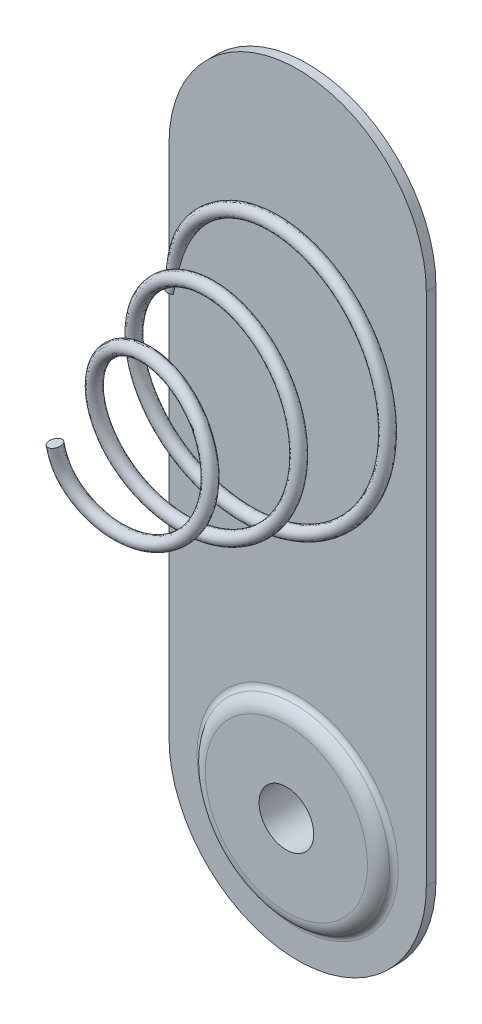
ISO-10303-21;
HEADER;
FILE_DESCRIPTION(('STEP AP214'),'2;1');
FILE_NAME('part.step','',(''),(''),'','','');
FILE_SCHEMA(('AUTOMOTIVE_DESIGN { 1 0 10303 214 1 1 1 1 }'));
ENDSEC;
DATA;
#1=APPLICATION_CONTEXT('core data for automotive mechanical design processes');
#2=APPLICATION_PROTOCOL_DEFINITION('international standard','automotive_design',2000,#1);
#3=PRODUCT_CONTEXT('',#1,'mechanical');
#4=PRODUCT('Part','Part','',(#3));
#5=PRODUCT_RELATED_PRODUCT_CATEGORY('part','',(#4));
#6=PRODUCT_DEFINITION_FORMATION('','',#4);
#7=PRODUCT_DEFINITION_CONTEXT('part definition',#1,'design');
#8=PRODUCT_DEFINITION('design','',#6,#7);
#9=PRODUCT_DEFINITION_SHAPE('','',#8);
#10=(LENGTH_UNIT() NAMED_UNIT(*) SI_UNIT(.MILLI.,.METRE.));
#11=(NAMED_UNIT(*) PLANE_ANGLE_UNIT() SI_UNIT($,.RADIAN.));
#12=(NAMED_UNIT(*) SI_UNIT($,.STERADIAN.) SOLID_ANGLE_UNIT());
#13=UNCERTAINTY_MEASURE_WITH_UNIT(LENGTH_MEASURE(1.E-05),#10,'distance_accuracy_value','');
#14=(GEOMETRIC_REPRESENTATION_CONTEXT(3) GLOBAL_UNCERTAINTY_ASSIGNED_CONTEXT((#13)) GLOBAL_UNIT_ASSIGNED_CONTEXT((#10,
#11,#12)) REPRESENTATION_CONTEXT('',''));
#15=CARTESIAN_POINT('',(0.,0.,0.));
#16=DIRECTION('',(0.,0.,1.));
#17=DIRECTION('',(1.,0.,0.));
#18=AXIS2_PLACEMENT_3D('',#15,#16,#17);
#19=CARTESIAN_POINT('',(0.,-12.,-1.85));
#20=DIRECTION('',(0.,0.,1.));
#21=DIRECTION('',(1.,0.,0.));
#22=AXIS2_PLACEMENT_3D('',#19,#20,#21);
#23=CYLINDRICAL_SURFACE('',#22,1.);
#24=CARTESIAN_POINT('',(0.,-12.,-0.15));
#25=DIRECTION('',(0.,0.,1.));
#26=DIRECTION('',(1.,0.,0.));
#27=AXIS2_PLACEMENT_3D('',#24,#25,#26);
#28=CIRCLE('',#27,1.);
#29=CARTESIAN_POINT('',(1.,-12.,-0.15));
#30=VERTEX_POINT('',#29);
#31=EDGE_CURVE('E117',#30,#30,#28,.T.);
#32=ORIENTED_EDGE('',*,*,#31,.F.);
#33=EDGE_LOOP('',(#32));
#34=FACE_BOUND('',#33,.T.);
#35=CARTESIAN_POINT('',(0.,-12.,-1.65));
#36=DIRECTION('',(0.,0.,-1.));
#37=DIRECTION('',(-1.,0.,0.));
#38=AXIS2_PLACEMENT_3D('',#35,#36,#37);
#39=CIRCLE('',#38,1.);
#40=CARTESIAN_POINT('',(-1.,-12.,-1.65));
#41=VERTEX_POINT('',#40);
#42=EDGE_CURVE('E34',#41,#41,#39,.F.);
#43=ORIENTED_EDGE('',*,*,#42,.T.);
#44=EDGE_LOOP('',(#43));
#45=FACE_BOUND('',#44,.T.);
#46=ADVANCED_FACE('F30',(#34,#45),#23,.T.);
#47=CARTESIAN_POINT('',(0.,4.,0.15));
#48=DIRECTION('',(0.,0.,1.));
#49=DIRECTION('',(1.,0.,0.));
#50=AXIS2_PLACEMENT_3D('',#47,#48,#49);
#51=PLANE('',#50);
#52=CARTESIAN_POINT('',(0.,-12.,0.15));
#53=DIRECTION('',(0.,0.,1.));
#54=DIRECTION('',(1.,0.,0.));
#55=AXIS2_PLACEMENT_3D('',#52,#53,#54);
#56=CIRCLE('',#55,3.12924818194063);
#57=CARTESIAN_POINT('',(3.12924818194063,-12.,0.15));
#58=VERTEX_POINT('',#57);
#59=EDGE_CURVE('E39',#58,#58,#56,.F.);
#60=ORIENTED_EDGE('',*,*,#59,.T.);
#61=EDGE_LOOP('',(#60));
#62=FACE_BOUND('',#61,.T.);
#63=DIRECTION('',(1.,0.,0.));
#64=VECTOR('',#63,1.);
#65=CARTESIAN_POINT('',(-4.,0.,0.15));
#66=LINE('',#65,#64);
#67=CARTESIAN_POINT('',(-4.,0.,0.15));
#68=VERTEX_POINT('',#67);
#69=CARTESIAN_POINT('',(-3.86771243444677,0.,0.15));
#70=VERTEX_POINT('',#69);
#71=EDGE_CURVE('E142',#68,#70,#66,.T.);
#72=ORIENTED_EDGE('',*,*,#71,.F.);
#73=DIRECTION('',(0.,-1.,0.));
#74=VECTOR('',#73,1.);
#75=CARTESIAN_POINT('',(-4.,4.,0.15));
#76=LINE('',#75,#74);
#77=CARTESIAN_POINT('',(-4.,-12.,0.15));
#78=VERTEX_POINT('',#77);
#79=EDGE_CURVE('E129',#68,#78,#76,.T.);
#80=ORIENTED_EDGE('',*,*,#79,.T.);
#81=CARTESIAN_POINT('',(0.,-12.,0.15));
#82=DIRECTION('',(0.,0.,1.));
#83=DIRECTION('',(1.,0.,0.));
#84=AXIS2_PLACEMENT_3D('',#81,#82,#83);
#85=CIRCLE('',#84,4.);
#86=CARTESIAN_POINT('',(4.,-12.,0.15));
#87=VERTEX_POINT('',#86);
#88=EDGE_CURVE('E131',#78,#87,#85,.T.);
#89=ORIENTED_EDGE('',*,*,#88,.T.);
#90=DIRECTION('',(0.,1.,0.));
#91=VECTOR('',#90,1.);
#92=CARTESIAN_POINT('',(4.,4.,0.15));
#93=LINE('',#92,#91);
#94=CARTESIAN_POINT('',(4.,4.,0.15));
#95=VERTEX_POINT('',#94);
#96=EDGE_CURVE('E133',#87,#95,#93,.T.);
#97=ORIENTED_EDGE('',*,*,#96,.T.);
#98=CARTESIAN_POINT('',(0.,4.,0.15));
#99=DIRECTION('',(0.,0.,1.));
#100=DIRECTION('',(1.,0.,0.));
#101=AXIS2_PLACEMENT_3D('',#98,#99,#100);
#102=CIRCLE('',#101,4.);
#103=CARTESIAN_POINT('',(-4.,4.,0.15));
#104=VERTEX_POINT('',#103);
#105=EDGE_CURVE('E127',#95,#104,#102,.T.);
#106=ORIENTED_EDGE('',*,*,#105,.T.);
#107=CARTESIAN_POINT('',(-4.,1.04414830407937,0.15));
#108=VERTEX_POINT('',#107);
#109=EDGE_CURVE('E107',#104,#108,#76,.T.);
#110=ORIENTED_EDGE('',*,*,#109,.T.);
#111=CARTESIAN_POINT('',(-3.99999999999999,1.04414830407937,0.15));
#112=CARTESIAN_POINT('',(-3.99282968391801,1.07563880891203,0.150000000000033));
#113=CARTESIAN_POINT('',(-3.9853004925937,1.10704842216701,0.150000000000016));
#114=CARTESIAN_POINT('',(-3.96948688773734,1.16967342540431,0.149999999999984));
#115=CARTESIAN_POINT('',(-3.96120254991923,1.20088883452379,0.149999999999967));
#116=CARTESIAN_POINT('',(-3.94383414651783,1.2631194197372,0.150000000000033));
#117=CARTESIAN_POINT('',(-3.9347495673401,1.29413445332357,0.150000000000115));
#118=CARTESIAN_POINT('',(-3.9157435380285,1.35591189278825,0.149999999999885));
#119=CARTESIAN_POINT('',(-3.90582190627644,1.38667424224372,0.149999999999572));
#120=CARTESIAN_POINT('',(-3.8674718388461,1.50002624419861,0.149999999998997));
#121=CARTESIAN_POINT('',(-3.83628429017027,1.58171885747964,0.149999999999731));
#122=CARTESIAN_POINT('',(-3.76666571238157,1.74197543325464,0.150000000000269));
#123=CARTESIAN_POINT('',(-3.72823317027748,1.8205387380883,0.150000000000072));
#124=CARTESIAN_POINT('',(-3.64479141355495,1.97427386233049,0.149999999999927));
#125=CARTESIAN_POINT('',(-3.5997692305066,2.04943860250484,0.149999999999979));
#126=CARTESIAN_POINT('',(-3.50394634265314,2.19599716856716,0.150000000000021));
#127=CARTESIAN_POINT('',(-3.45314439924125,2.26739018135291,0.150000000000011));
#128=CARTESIAN_POINT('',(-3.34534686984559,2.40759393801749,0.149999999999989));
#129=CARTESIAN_POINT('',(-3.28824854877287,2.47632554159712,0.149999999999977));
#130=CARTESIAN_POINT('',(-3.16911728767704,2.60937089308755,0.150000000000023));
#131=CARTESIAN_POINT('',(-3.10708438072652,2.67368467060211,0.150000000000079));
#132=CARTESIAN_POINT('',(-2.97851275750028,2.79733523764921,0.149999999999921));
#133=CARTESIAN_POINT('',(-2.91198453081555,2.85668293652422,0.149999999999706));
#134=CARTESIAN_POINT('',(-2.77462304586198,2.97013839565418,0.150000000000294));
#135=CARTESIAN_POINT('',(-2.70379139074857,3.02424808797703,0.150000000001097));
#136=CARTESIAN_POINT('',(-2.59081852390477,3.10363635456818,0.15000000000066));
#137=CARTESIAN_POINT('',(-2.55009031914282,3.13094288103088,0.150000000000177));
#138=CARTESIAN_POINT('',(-2.46740049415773,3.18363708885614,0.149999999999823));
#139=CARTESIAN_POINT('',(-2.42543878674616,3.20902463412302,0.149999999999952));
#140=CARTESIAN_POINT('',(-2.34015797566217,3.25773727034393,0.150000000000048));
#141=CARTESIAN_POINT('',(-2.29683501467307,3.2810556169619,0.150000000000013));
#142=CARTESIAN_POINT('',(-2.20895349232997,3.32520670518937,0.149999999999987));
#143=CARTESIAN_POINT('',(-2.16439558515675,3.34604073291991,0.149999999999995));
#144=CARTESIAN_POINT('',(-2.09651676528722,3.37498130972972,0.150000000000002));
#145=CARTESIAN_POINT('',(-2.07369083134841,3.38425212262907,0.150000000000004));
#146=CARTESIAN_POINT('',(-2.02766773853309,3.40186162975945,0.149999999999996));
#147=CARTESIAN_POINT('',(-2.00447040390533,3.41019986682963,0.149999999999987));
#148=CARTESIAN_POINT('',(-1.95782897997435,3.42563892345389,0.150000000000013));
#149=CARTESIAN_POINT('',(-1.93438760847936,3.43274770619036,0.150000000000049));
#150=CARTESIAN_POINT('',(-1.89886918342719,3.44208046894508,0.149999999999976));
#151=CARTESIAN_POINT('',(-1.88696719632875,3.44497022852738,0.14999999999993));
#152=CARTESIAN_POINT('',(-1.86303334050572,3.45013949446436,0.15000000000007));
#153=CARTESIAN_POINT('',(-1.85100157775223,3.45241946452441,0.150000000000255));
#154=CARTESIAN_POINT('',(-1.83087322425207,3.45540348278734,0.149999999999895));
#155=CARTESIAN_POINT('',(-1.82281702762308,3.45637968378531,0.149999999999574));
#156=CARTESIAN_POINT('',(-1.80666017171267,3.45768042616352,0.150000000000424));
#157=CARTESIAN_POINT('',(-1.79855973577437,3.4580070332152,0.150000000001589));
#158=CARTESIAN_POINT('',(-1.78639393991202,3.45753761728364,0.1500000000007));
#159=CARTESIAN_POINT('',(-1.78231564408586,3.45721719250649,0.149999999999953));
#160=CARTESIAN_POINT('',(-1.77424581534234,3.45604790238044,0.150000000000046));
#161=CARTESIAN_POINT('',(-1.77025394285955,3.45520177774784,0.150000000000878));
#162=CARTESIAN_POINT('',(-1.76332451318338,3.45277828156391,0.150000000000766));
#163=CARTESIAN_POINT('',(-1.7603365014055,3.451382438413,0.150000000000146));
#164=CARTESIAN_POINT('',(-1.75610573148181,3.44821314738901,0.14999999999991));
#165=CARTESIAN_POINT('',(-1.7546296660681,3.4467803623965,0.150000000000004));
#166=CARTESIAN_POINT('',(-1.75228546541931,3.44344941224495,0.149999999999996));
#167=CARTESIAN_POINT('',(-1.75142136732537,3.44154826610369,0.149999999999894));
#168=CARTESIAN_POINT('',(-1.75048353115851,3.43777716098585,0.150000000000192));
#169=CARTESIAN_POINT('',(-1.7503405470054,3.4359224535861,0.150000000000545));
#170=CARTESIAN_POINT('',(-1.75053843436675,3.43083224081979,0.150000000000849));
#171=CARTESIAN_POINT('',(-1.75133538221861,3.42763052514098,0.150000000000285));
#172=CARTESIAN_POINT('',(-1.75392554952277,3.42038001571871,0.149999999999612));
#173=CARTESIAN_POINT('',(-1.75597464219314,3.41644294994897,0.149999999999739));
#174=CARTESIAN_POINT('',(-1.76056678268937,3.40884834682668,0.150000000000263));
#175=CARTESIAN_POINT('',(-1.76311322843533,3.40519298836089,0.150000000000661));
#176=CARTESIAN_POINT('',(-1.77161395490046,3.39390439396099,0.150000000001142));
#177=CARTESIAN_POINT('',(-1.77805488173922,3.38664718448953,0.150000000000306));
#178=CARTESIAN_POINT('',(-1.79141476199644,3.37258203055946,0.149999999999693));
#179=CARTESIAN_POINT('',(-1.79833498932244,3.3657753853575,0.149999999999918));
#180=CARTESIAN_POINT('',(-1.8124488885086,3.35243940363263,0.150000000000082));
#181=CARTESIAN_POINT('',(-1.81964274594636,3.34591026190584,0.150000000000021));
#182=CARTESIAN_POINT('',(-1.83417691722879,3.3330419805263,0.149999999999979));
#183=CARTESIAN_POINT('',(-1.84151699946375,3.32670257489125,0.149999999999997));
#184=CARTESIAN_POINT('',(-1.8635045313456,3.30801691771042,0.150000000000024));
#185=CARTESIAN_POINT('',(-1.87829726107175,3.29584196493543,0.150000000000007));
#186=CARTESIAN_POINT('',(-1.90805516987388,3.27170417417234,0.149999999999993));
#187=CARTESIAN_POINT('',(-1.92302036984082,3.25974136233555,0.149999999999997));
#188=CARTESIAN_POINT('',(-1.96803929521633,3.22396299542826,0.150000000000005));
#189=CARTESIAN_POINT('',(-1.9981944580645,3.20027531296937,0.150000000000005));
#190=CARTESIAN_POINT('',(-2.0583493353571,3.15277813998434,0.149999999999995));
#191=CARTESIAN_POINT('',(-2.08834919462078,3.1289688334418,0.149999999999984));
#192=CARTESIAN_POINT('',(-2.14805994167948,3.08100161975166,0.150000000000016));
#193=CARTESIAN_POINT('',(-2.1777708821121,3.05684377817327,0.150000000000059));
#194=CARTESIAN_POINT('',(-2.26464960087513,2.98503221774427,0.150000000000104));
#195=CARTESIAN_POINT('',(-2.32127529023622,2.93671461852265,0.150000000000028));
#196=CARTESIAN_POINT('',(-2.43259833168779,2.83791014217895,0.149999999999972));
#197=CARTESIAN_POINT('',(-2.48729561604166,2.7874231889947,0.14999999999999));
#198=CARTESIAN_POINT('',(-2.64812587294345,2.63236190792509,0.15000000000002));
#199=CARTESIAN_POINT('',(-2.75092588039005,2.52424490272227,0.150000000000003));
#200=CARTESIAN_POINT('',(-2.89664927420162,2.355180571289,0.149999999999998));
#201=CARTESIAN_POINT('',(-2.94373725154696,2.29778221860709,0.15));
#202=CARTESIAN_POINT('',(-3.0349653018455,2.18069150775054,0.15));
#203=CARTESIAN_POINT('',(-3.07910509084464,2.12099892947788,0.149999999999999));
#204=CARTESIAN_POINT('',(-3.20630314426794,1.9384919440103,0.150000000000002));
#205=CARTESIAN_POINT('',(-3.28433970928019,1.81202091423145,0.150000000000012));
#206=CARTESIAN_POINT('',(-3.37052220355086,1.64884301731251,0.149999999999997));
#207=CARTESIAN_POINT('',(-3.38697676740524,1.61640518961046,0.149999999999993));
#208=CARTESIAN_POINT('',(-3.41876164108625,1.55098309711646,0.150000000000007));
#209=CARTESIAN_POINT('',(-3.43409203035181,1.51799887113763,0.150000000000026));
#210=CARTESIAN_POINT('',(-3.47845311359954,1.41832852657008,0.149999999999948));
#211=CARTESIAN_POINT('',(-3.50585850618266,1.35091564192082,0.149999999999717));
#212=CARTESIAN_POINT('',(-3.55690407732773,1.21462750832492,0.150000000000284));
#213=CARTESIAN_POINT('',(-3.580540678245,1.14575093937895,0.150000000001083));
#214=CARTESIAN_POINT('',(-3.62466132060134,1.00699862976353,0.149999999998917));
#215=CARTESIAN_POINT('',(-3.6451451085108,0.937122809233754,0.149999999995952));
#216=CARTESIAN_POINT('',(-3.69111190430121,0.769266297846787,0.14999999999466));
#217=CARTESIAN_POINT('',(-3.71542214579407,0.670969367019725,0.149999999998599));
#218=CARTESIAN_POINT('',(-3.76154048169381,0.473873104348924,0.150000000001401));
#219=CARTESIAN_POINT('',(-3.78334990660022,0.375074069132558,0.150000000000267));
#220=CARTESIAN_POINT('',(-3.81540232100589,0.230186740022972,0.149999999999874));
#221=CARTESIAN_POINT('',(-3.82561001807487,0.184091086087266,0.149999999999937));
#222=CARTESIAN_POINT('',(-3.8463457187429,0.0919734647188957,0.150000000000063));
#223=CARTESIAN_POINT('',(-3.85687371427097,0.0459514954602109,0.150000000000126));
#224=CARTESIAN_POINT('',(-3.86771243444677,0.,0.15));
#225=B_SPLINE_CURVE_WITH_KNOTS('',3,(#111,#112,#113,#114,#115,#116,#117,#118,#119,#120,#121,
#122,#123,#124,#125,#126,#127,#128,#129,#130,#131,#132,#133,#134,#135,#136,#137,#138,#139,#140,
#141,#142,#143,#144,#145,#146,#147,#148,#149,#150,#151,#152,#153,#154,#155,#156,#157,#158,#159,
#160,#161,#162,#163,#164,#165,#166,#167,#168,#169,#170,#171,#172,#173,#174,#175,#176,#177,#178,
#179,#180,#181,#182,#183,#184,#185,#186,#187,#188,#189,#190,#191,#192,#193,#194,#195,#196,#197,
#198,#199,#200,#201,#202,#203,#204,#205,#206,#207,#208,#209,#210,#211,#212,#213,#214,#215,#216,
#217,#218,#219,#220,#221,#222,#223,#224),.UNSPECIFIED.,.F.,.F.,(4,2,2,2,2,2,2,2,2,2,2,2,2,2,2,2,
2,2,2,2,2,2,2,2,2,2,2,2,2,2,2,2,2,2,2,2,2,2,2,2,2,2,2,2,2,2,2,2,2,2,2,2,2,2,2,2,4),(0.,
0.0968884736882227,0.193767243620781,0.290708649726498,0.387671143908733,0.649653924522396,
0.911691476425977,1.17425183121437,1.43686855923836,1.70468618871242,1.97250202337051,
2.23971317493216,2.50682538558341,2.65388739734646,2.80095982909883,2.94849525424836,
3.0959539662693,3.169848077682,3.24377825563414,3.31721002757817,3.35394487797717,
3.39065171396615,3.41498736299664,3.43924550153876,3.45149819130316,3.46368753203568,
3.47342268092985,3.47948824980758,3.48559346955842,3.49109949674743,3.50083524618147,
3.5140874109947,3.52743349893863,3.55647093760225,3.58558875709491,3.61472668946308,
3.64382165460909,3.70129142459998,3.75876823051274,3.87380648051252,3.98870430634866,
4.10358079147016,4.32683989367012,4.55010683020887,4.99691530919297,5.21955531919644,
5.44221674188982,5.88663587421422,5.99574118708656,6.10483878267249,6.32300319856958,
6.54137349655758,6.75976134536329,7.0634571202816,7.36699056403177,7.5086268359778,
7.6502595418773),.UNSPECIFIED.);
#226=EDGE_CURVE('E55',#108,#70,#225,.T.);
#227=ORIENTED_EDGE('',*,*,#226,.T.);
#228=EDGE_LOOP('',(#72,#80,#89,#97,#106,#110,#227));
#229=FACE_BOUND('',#228,.T.);
#230=ADVANCED_FACE('F176',(#62,#229),#51,.T.);
#231=CARTESIAN_POINT('',(-1.69681578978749,0.,5.99999999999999));
#232=DIRECTION('',(-0.190719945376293,0.975695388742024,0.107909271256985));
#233=DIRECTION('',(0.0461119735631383,-0.100901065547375,0.993827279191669));
#234=AXIS2_PLACEMENT_3D('',#231,#232,#233);
#235=PLANE('',#234);
#236=CARTESIAN_POINT('',(-1.69681578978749,0.,5.99999999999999));
#237=DIRECTION('',(-0.190719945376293,0.975695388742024,0.107909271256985));
#238=DIRECTION('',(0.0461119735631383,-0.100901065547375,0.993827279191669));
#239=AXIS2_PLACEMENT_3D('',#236,#237,#238);
#240=CIRCLE('',#239,0.2);
#241=CARTESIAN_POINT('',(-1.68759339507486,-0.0201802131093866,6.19876545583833));
#242=VERTEX_POINT('',#241);
#243=EDGE_CURVE('E146',#242,#242,#240,.T.);
#244=ORIENTED_EDGE('',*,*,#243,.T.);
#245=EDGE_LOOP('',(#244));
#246=FACE_BOUND('',#245,.T.);
#247=ADVANCED_FACE('F180',(#246),#235,.T.);
#248=CARTESIAN_POINT('',(-4.,0.,0.));
#249=DIRECTION('',(0.,1.,0.));
#250=DIRECTION('',(0.,0.,1.));
#251=AXIS2_PLACEMENT_3D('',#248,#249,#250);
#252=PLANE('',#251);
#253=DIRECTION('',(0.,0.,-1.));
#254=VECTOR('',#253,1.);
#255=CARTESIAN_POINT('',(-4.,0.,0.));
#256=LINE('',#255,#254);
#257=CARTESIAN_POINT('',(-4.,0.,-0.15));
#258=VERTEX_POINT('',#257);
#259=EDGE_CURVE('E144',#68,#258,#256,.T.);
#260=ORIENTED_EDGE('',*,*,#259,.F.);
#261=ORIENTED_EDGE('',*,*,#71,.T.);
#262=CARTESIAN_POINT('',(-4.,0.,0.));
#263=DIRECTION('',(0.,1.,0.));
#264=DIRECTION('',(0.,0.,1.));
#265=AXIS2_PLACEMENT_3D('',#262,#263,#264);
#266=CIRCLE('',#265,0.2);
#267=CARTESIAN_POINT('',(-3.86771243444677,0.,-0.15));
#268=VERTEX_POINT('',#267);
#269=EDGE_CURVE('E149',#268,#70,#266,.T.);
#270=ORIENTED_EDGE('',*,*,#269,.F.);
#271=DIRECTION('',(1.,0.,0.));
#272=VECTOR('',#271,1.);
#273=CARTESIAN_POINT('',(-4.,0.,-0.15));
#274=LINE('',#273,#272);
#275=EDGE_CURVE('E47',#258,#268,#274,.T.);
#276=ORIENTED_EDGE('',*,*,#275,.F.);
#277=EDGE_LOOP('',(#260,#261,#270,#276));
#278=FACE_BOUND('',#277,.T.);
#279=ADVANCED_FACE('F32',(#278),#252,.F.);
#280=CARTESIAN_POINT('',(-4.,0.,0.2));
#281=CARTESIAN_POINT('',(-3.95955414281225,0.278530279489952,0.22231873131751));
#282=CARTESIAN_POINT('',(-3.88019416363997,0.831714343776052,0.266636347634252));
#283=CARTESIAN_POINT('',(-3.63186594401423,1.63967999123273,0.33515891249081));
#284=CARTESIAN_POINT('',(-3.17585543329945,2.35401811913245,0.403186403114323));
#285=CARTESIAN_POINT('',(-2.57881752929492,2.95453459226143,0.471251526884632));
#286=CARTESIAN_POINT('',(-1.86945368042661,3.41853640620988,0.540499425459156));
#287=CARTESIAN_POINT('',(-1.07763703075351,3.7169636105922,0.610139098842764));
#288=CARTESIAN_POINT('',(-0.239708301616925,3.83635074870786,0.680021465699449));
#289=CARTESIAN_POINT('',(0.604434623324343,3.76840666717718,0.750499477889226));
#290=CARTESIAN_POINT('',(1.41293679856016,3.51674324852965,0.821507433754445));
#291=CARTESIAN_POINT('',(2.14482614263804,3.09100035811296,0.892996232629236));
#292=CARTESIAN_POINT('',(2.76357270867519,2.51298302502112,0.965024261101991));
#293=CARTESIAN_POINT('',(3.22775405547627,1.82173380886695,1.03635330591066));
#294=CARTESIAN_POINT('',(3.52203069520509,1.05905829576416,1.1069765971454));
#295=CARTESIAN_POINT('',(3.64188736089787,0.264691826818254,1.17685270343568));
#296=CARTESIAN_POINT('',(3.58434158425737,-0.536572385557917,1.24726413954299));
#297=CARTESIAN_POINT('',(3.35249232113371,-1.30575421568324,1.31819259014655));
#298=CARTESIAN_POINT('',(2.95473931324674,-2.00378317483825,1.38966023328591));
#299=CARTESIAN_POINT('',(2.41158475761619,-2.5957288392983,1.46169312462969));
#300=CARTESIAN_POINT('',(1.74856085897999,-3.04955487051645,1.53426884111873));
#301=CARTESIAN_POINT('',(0.999871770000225,-3.34100716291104,1.60745051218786));
#302=CARTESIAN_POINT('',(0.204299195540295,-3.45362267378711,1.68120053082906));
#303=CARTESIAN_POINT('',(-0.595715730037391,-3.37885024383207,1.75557237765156));
#304=CARTESIAN_POINT('',(-1.35663811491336,-3.12074226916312,1.83056704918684));
#305=CARTESIAN_POINT('',(-2.03548153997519,-2.69069885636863,1.90618545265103));
#306=CARTESIAN_POINT('',(-2.59341536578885,-2.11243398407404,1.9824822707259));
#307=CARTESIAN_POINT('',(-2.99752872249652,-1.41778085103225,2.05943085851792));
#308=CARTESIAN_POINT('',(-3.22190496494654,-0.646127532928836,2.13707338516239));
#309=CARTESIAN_POINT('',(-3.25161239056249,0.12746459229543,2.21256402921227));
#310=CARTESIAN_POINT('',(-3.10699729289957,0.855979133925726,2.28571262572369));
#311=CARTESIAN_POINT('',(-2.81761493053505,1.50790160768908,2.35658192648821));
#312=CARTESIAN_POINT('',(-2.39099870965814,2.07952927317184,2.42802660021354));
#313=CARTESIAN_POINT('',(-1.84686186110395,2.54069240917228,2.50011159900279));
#314=CARTESIAN_POINT('',(-1.21301058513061,2.86777358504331,2.57282750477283));
#315=CARTESIAN_POINT('',(-0.521108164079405,3.04122326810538,2.64619065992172));
#316=CARTESIAN_POINT('',(0.192083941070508,3.05151550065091,2.72024628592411));
#317=CARTESIAN_POINT('',(0.888273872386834,2.89605399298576,2.79496729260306));
#318=CARTESIAN_POINT('',(1.52858106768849,2.58171231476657,2.87042224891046));
#319=CARTESIAN_POINT('',(2.07688154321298,2.12543639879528,2.94659753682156));
#320=CARTESIAN_POINT('',(2.50009608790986,1.5511735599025,3.02352034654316));
#321=CARTESIAN_POINT('',(2.77279333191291,0.892036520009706,3.10123988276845));
#322=CARTESIAN_POINT('',(2.87713019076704,0.186353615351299,3.17973051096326));
#323=CARTESIAN_POINT('',(2.80692690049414,-0.49726270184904,3.25615512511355));
#324=CARTESIAN_POINT('',(2.58805098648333,-1.11904809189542,3.3303312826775));
#325=CARTESIAN_POINT('',(2.24949422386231,-1.65401623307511,3.40224583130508));
#326=CARTESIAN_POINT('',(1.79919582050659,-2.09892721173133,3.47489438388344));
#327=CARTESIAN_POINT('',(1.25947859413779,-2.42976811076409,3.54825053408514));
#328=CARTESIAN_POINT('',(0.658030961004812,-2.62720733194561,3.62238413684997));
#329=CARTESIAN_POINT('',(0.027246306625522,-2.68003573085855,3.69728969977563));
#330=CARTESIAN_POINT('',(-0.598271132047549,-2.58284850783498,3.77299294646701));
#331=CARTESIAN_POINT('',(-1.18288773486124,-2.34022520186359,3.84954880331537));
#332=CARTESIAN_POINT('',(-1.69234220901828,-1.96455269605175,3.9269397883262));
#333=CARTESIAN_POINT('',(-2.09514081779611,-1.47627936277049,4.00523504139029));
#334=CARTESIAN_POINT('',(-2.36618506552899,-0.90433465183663,4.08445252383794));
#335=CARTESIAN_POINT('',(-2.48668149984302,-0.282956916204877,4.16460469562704));
#336=CARTESIAN_POINT('',(-2.44705540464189,0.348740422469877,4.24576909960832));
#337=CARTESIAN_POINT('',(-2.24852248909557,0.94959231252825,4.32793691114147));
#338=CARTESIAN_POINT('',(-1.93033490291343,1.43531523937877,4.4042982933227));
#339=CARTESIAN_POINT('',(-1.54979578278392,1.79689934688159,4.47442894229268));
#340=CARTESIAN_POINT('',(-1.14937720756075,2.04834591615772,4.53822010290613));
#341=CARTESIAN_POINT('',(-0.706628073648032,2.21405008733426,4.60269570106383));
#342=CARTESIAN_POINT('',(-0.239605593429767,2.2869694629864,4.66782485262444));
#343=CARTESIAN_POINT('',(0.232399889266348,2.26230722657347,4.73368666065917));
#344=CARTESIAN_POINT('',(0.689124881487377,2.14096549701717,4.8002500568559));
#345=CARTESIAN_POINT('',(1.11009509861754,1.92630368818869,4.8675858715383));
#346=CARTESIAN_POINT('',(1.47634963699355,1.62787147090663,4.93568569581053));
#347=CARTESIAN_POINT('',(1.76987626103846,1.25770088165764,5.00459422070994));
#348=CARTESIAN_POINT('',(1.97645661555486,0.832957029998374,5.07434448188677));
#349=CARTESIAN_POINT('',(2.08484953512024,0.37331520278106,5.14493689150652));
#350=CARTESIAN_POINT('',(2.08828640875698,-0.0815187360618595,5.21383128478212));
#351=CARTESIAN_POINT('',(1.99896994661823,-0.50869676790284,5.28081616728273));
#352=CARTESIAN_POINT('',(1.83174079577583,-0.892925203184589,5.34594136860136));
#353=CARTESIAN_POINT('',(1.58967030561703,-1.23482790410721,5.41181809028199));
#354=CARTESIAN_POINT('',(1.28172852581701,-1.51878461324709,5.47854763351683));
#355=CARTESIAN_POINT('',(0.921425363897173,-1.73211665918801,5.5460873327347));
#356=CARTESIAN_POINT('',(0.523884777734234,-1.86350543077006,5.61455451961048));
#357=CARTESIAN_POINT('',(0.107425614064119,-1.9062563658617,5.68394297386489));
#358=CARTESIAN_POINT('',(-0.308113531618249,-1.85744169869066,5.75418312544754));
#359=CARTESIAN_POINT('',(-0.702761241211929,-1.71905175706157,5.82544460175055));
#360=CARTESIAN_POINT('',(-1.05384131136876,-1.4908370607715,5.89815976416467));
#361=CARTESIAN_POINT('',(-1.34684599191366,-1.193133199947,5.97139603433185));
#362=CARTESIAN_POINT('',(-1.57409379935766,-0.840994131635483,6.0450490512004));
#363=CARTESIAN_POINT('',(-1.67196014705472,-0.433928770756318,6.12242305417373));
#364=CARTESIAN_POINT('',(-1.68138576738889,-0.158676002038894,6.17320315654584));
#365=CARTESIAN_POINT('',(-1.68759339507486,-0.0201802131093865,6.19876545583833));
#366=CARTESIAN_POINT('',(-3.6,0.,0.2));
#367=CARTESIAN_POINT('',(-3.55951483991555,0.278800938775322,0.222340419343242));
#368=CARTESIAN_POINT('',(-3.47849824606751,0.816170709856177,0.265779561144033));
#369=CARTESIAN_POINT('',(-3.24385775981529,1.52418171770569,0.3251039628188));
#370=CARTESIAN_POINT('',(-2.8299265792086,2.14690012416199,0.395710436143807));
#371=CARTESIAN_POINT('',(-2.28147475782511,2.68305671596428,0.467385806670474));
#372=CARTESIAN_POINT('',(-1.63562609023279,3.08999739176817,0.534510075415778));
#373=CARTESIAN_POINT('',(-0.922714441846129,3.34471341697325,0.603503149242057));
#374=CARTESIAN_POINT('',(-0.168582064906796,3.43949322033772,0.674353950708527));
#375=CARTESIAN_POINT('',(0.585833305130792,3.36552080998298,0.744727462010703));
#376=CARTESIAN_POINT('',(1.30592116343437,3.12793259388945,0.815529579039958));
#377=CARTESIAN_POINT('',(1.95384209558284,2.73565748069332,0.887352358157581));
#378=CARTESIAN_POINT('',(2.4972567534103,2.21000690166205,0.959155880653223));
#379=CARTESIAN_POINT('',(2.90127295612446,1.58493039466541,1.03085118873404));
#380=CARTESIAN_POINT('',(3.15115608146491,0.900959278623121,1.10124479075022));
#381=CARTESIAN_POINT('',(3.24561741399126,0.190235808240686,1.17140195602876));
#382=CARTESIAN_POINT('',(3.18133068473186,-0.521321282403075,1.24174615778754));
#383=CARTESIAN_POINT('',(2.96272341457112,-1.20225425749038,1.31270041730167));
#384=CARTESIAN_POINT('',(2.59778063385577,-1.8158158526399,1.38438833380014));
#385=CARTESIAN_POINT('',(2.10626186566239,-2.33210199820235,1.45619730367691));
#386=CARTESIAN_POINT('',(1.51012483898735,-2.72403536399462,1.52917377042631));
#387=CARTESIAN_POINT('',(0.842837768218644,-2.96926911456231,1.60213166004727));
#388=CARTESIAN_POINT('',(0.13603059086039,-3.05587189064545,1.67613218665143));
#389=CARTESIAN_POINT('',(-0.569346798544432,-2.97599211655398,1.75055547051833));
#390=CARTESIAN_POINT('',(-1.23681777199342,-2.73526041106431,1.8254023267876));
#391=CARTESIAN_POINT('',(-1.82859039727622,-2.34389968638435,1.90142199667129));
#392=CARTESIAN_POINT('',(-2.30939562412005,-1.82530910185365,1.97751058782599));
#393=CARTESIAN_POINT('',(-2.65337081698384,-1.2064064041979,2.05468284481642));
#394=CARTESIAN_POINT('',(-2.83655323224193,-0.524534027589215,2.13246154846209));
#395=CARTESIAN_POINT('',(-2.84893327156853,0.154525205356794,2.20774741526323));
#396=CARTESIAN_POINT('',(-2.70891302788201,0.791373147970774,2.28133895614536));
#397=CARTESIAN_POINT('',(-2.44400151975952,1.35595715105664,2.3519619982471));
#398=CARTESIAN_POINT('',(-2.06005946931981,1.84891216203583,2.42371742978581));
#399=CARTESIAN_POINT('',(-1.57672945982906,2.24096902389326,2.49580851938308));
#400=CARTESIAN_POINT('',(-1.01761838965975,2.51477939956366,2.56843391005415));
#401=CARTESIAN_POINT('',(-0.411490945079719,2.65276312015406,2.64220536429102));
#402=CARTESIAN_POINT('',(0.208382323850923,2.64822348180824,2.71597745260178));
#403=CARTESIAN_POINT('',(0.811053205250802,2.49979634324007,2.79113188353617));
#404=CARTESIAN_POINT('',(1.35953040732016,2.21496764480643,2.86651374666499));
#405=CARTESIAN_POINT('',(1.82593219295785,1.8090662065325,2.94266192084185));
#406=CARTESIAN_POINT('',(2.18054163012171,1.30398394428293,3.01999530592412));
#407=CARTESIAN_POINT('',(2.40260899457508,0.730199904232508,3.09747919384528));
#408=CARTESIAN_POINT('',(2.47867560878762,0.119104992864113,3.17630547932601));
#409=CARTESIAN_POINT('',(2.40424286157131,-0.46714882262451,3.2528736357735));
#410=CARTESIAN_POINT('',(2.2037300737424,-0.996657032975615,3.32680913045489));
#411=CARTESIAN_POINT('',(1.90206368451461,-1.44884796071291,3.39928886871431));
#412=CARTESIAN_POINT('',(1.50787958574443,-1.81972156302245,3.47161502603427));
#413=CARTESIAN_POINT('',(1.03895273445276,-2.09176316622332,3.54542504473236));
#414=CARTESIAN_POINT('',(0.52236085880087,-2.24696990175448,3.61954740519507));
#415=CARTESIAN_POINT('',(-0.0162045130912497,-2.27867871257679,3.69436501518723));
#416=CARTESIAN_POINT('',(-0.545830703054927,-2.1823768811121,3.7705960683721));
#417=CARTESIAN_POINT('',(-1.03573060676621,-1.96407689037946,3.84686566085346));
#418=CARTESIAN_POINT('',(-1.45942783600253,-1.63446298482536,3.92469247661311));
#419=CARTESIAN_POINT('',(-1.78820114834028,-1.21332281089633,4.00310752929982));
#420=CARTESIAN_POINT('',(-2.00377571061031,-0.725418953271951,4.08213088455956));
#421=CARTESIAN_POINT('',(-2.09104643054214,-0.199591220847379,4.16287007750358));
#422=CARTESIAN_POINT('',(-2.04307195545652,0.328697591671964,4.24402831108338));
#423=CARTESIAN_POINT('',(-1.86309097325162,0.826932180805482,4.32603322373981));
#424=CARTESIAN_POINT('',(-1.5856849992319,1.22518767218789,4.40313891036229));
#425=CARTESIAN_POINT('',(-1.26089441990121,1.51642716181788,4.47286372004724));
#426=CARTESIAN_POINT('',(-0.921417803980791,1.71633088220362,4.53732322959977));
#427=CARTESIAN_POINT('',(-0.55129840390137,1.84242155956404,4.60142449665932));
#428=CARTESIAN_POINT('',(-0.162219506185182,1.89162202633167,4.6671835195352));
#429=CARTESIAN_POINT('',(0.225590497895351,1.85944879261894,4.73278313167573));
#430=CARTESIAN_POINT('',(0.599555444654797,1.74807513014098,4.79982608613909));
#431=CARTESIAN_POINT('',(0.938872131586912,1.56141526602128,4.86714083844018));
#432=CARTESIAN_POINT('',(1.2319405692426,1.30732321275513,4.9353972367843));
#433=CARTESIAN_POINT('',(1.46164388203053,0.997720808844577,5.00472025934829));
#434=CARTESIAN_POINT('',(1.61902493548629,0.646294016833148,5.07407040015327));
#435=CARTESIAN_POINT('',(1.69490395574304,0.269981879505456,5.14561626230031));
#436=CARTESIAN_POINT('',(1.68556260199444,-0.0977303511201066,5.21395442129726));
#437=CARTESIAN_POINT('',(1.60190934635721,-0.440941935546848,5.28188340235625));
#438=CARTESIAN_POINT('',(1.45713219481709,-0.744755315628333,5.34649300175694));
#439=CARTESIAN_POINT('',(1.25309844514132,-1.01330146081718,5.41324016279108));
#440=CARTESIAN_POINT('',(0.999581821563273,-1.23102862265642,5.47957722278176));
#441=CARTESIAN_POINT('',(0.705611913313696,-1.39169290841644,5.54794103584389));
#442=CARTESIAN_POINT('',(0.386918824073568,-1.48430367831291,5.61628422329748));
#443=CARTESIAN_POINT('',(0.055294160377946,-1.5064234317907,5.68536293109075));
#444=CARTESIAN_POINT('',(-0.270497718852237,-1.45582046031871,5.75680169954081));
#445=CARTESIAN_POINT('',(-0.575832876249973,-1.33601367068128,5.83005382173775));
#446=CARTESIAN_POINT('',(-0.843179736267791,-1.14691123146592,5.89790568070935));
#447=CARTESIAN_POINT('',(-1.06757017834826,-0.902397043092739,5.97248945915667));
#448=CARTESIAN_POINT('',(-1.22890261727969,-0.62705266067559,6.05895592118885));
#449=CARTESIAN_POINT('',(-1.2805065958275,-0.335986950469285,6.11647968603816));
#450=CARTESIAN_POINT('',(-1.28914787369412,-0.0811709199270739,6.16284839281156));
#451=CARTESIAN_POINT('',(-1.29536905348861,0.0576272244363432,6.18846649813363));
#452=CARTESIAN_POINT('',(-3.6,0.,-0.2));
#453=CARTESIAN_POINT('',(-3.55951483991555,0.278800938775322,-0.177659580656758));
#454=CARTESIAN_POINT('',(-3.47949589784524,0.81633197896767,-0.134242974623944));
#455=CARTESIAN_POINT('',(-3.25303768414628,1.52906590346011,-0.0747781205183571));
#456=CARTESIAN_POINT('',(-2.83536203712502,2.15240526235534,-0.00421849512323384));
#457=CARTESIAN_POINT('',(-2.28339906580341,2.68676146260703,0.0674036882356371));
#458=CARTESIAN_POINT('',(-1.63747736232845,3.09613944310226,0.134560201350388));
#459=CARTESIAN_POINT('',(-0.923046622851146,3.35182718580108,0.203565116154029));
#460=CARTESIAN_POINT('',(-0.167133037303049,3.44556976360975,0.274401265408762));
#461=CARTESIAN_POINT('',(0.588810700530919,3.37123409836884,0.34477836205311));
#462=CARTESIAN_POINT('',(1.31046355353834,3.13294864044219,0.415585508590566));
#463=CARTESIAN_POINT('',(1.95937758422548,2.7391692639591,0.487404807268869));
#464=CARTESIAN_POINT('',(2.50381802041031,2.21214036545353,0.559214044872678));
#465=CARTESIAN_POINT('',(2.90796705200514,1.58518694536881,0.630905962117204));
#466=CARTESIAN_POINT('',(3.15805455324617,0.899552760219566,0.701305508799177));
#467=CARTESIAN_POINT('',(3.25182027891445,0.187078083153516,0.771461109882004));
#468=CARTESIAN_POINT('',(3.18674217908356,-0.526012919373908,0.841809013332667));
#469=CARTESIAN_POINT('',(2.96685963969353,-1.2083188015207,0.912766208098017));
#470=CARTESIAN_POINT('',(2.60017475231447,-1.82273315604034,0.98445388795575));
#471=CARTESIAN_POINT('',(2.10697385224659,-2.33978571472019,1.0562700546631));
#472=CARTESIAN_POINT('',(1.50867308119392,-2.73149880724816,1.1292442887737));
#473=CARTESIAN_POINT('',(0.83950686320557,-2.97652592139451,1.20220969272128));
#474=CARTESIAN_POINT('',(0.130782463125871,-3.06198210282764,1.27621120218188));
#475=CARTESIAN_POINT('',(-0.576124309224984,-2.98065059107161,1.35063830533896));
#476=CARTESIAN_POINT('',(-1.2449118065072,-2.73822553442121,1.42549289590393));
#477=CARTESIAN_POINT('',(-1.83717219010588,-2.344410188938,1.50151208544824));
#478=CARTESIAN_POINT('',(-2.31824660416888,-1.82365359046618,1.57760974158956));
#479=CARTESIAN_POINT('',(-2.66157042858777,-1.20226115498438,1.65478548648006));
#480=CARTESIAN_POINT('',(-2.84346628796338,-0.518217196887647,1.73256881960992));
#481=CARTESIAN_POINT('',(-2.85437526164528,0.162700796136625,1.80786511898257));
#482=CARTESIAN_POINT('',(-2.71188299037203,0.800758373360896,1.88145759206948));
#483=CARTESIAN_POINT('',(-2.44489216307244,1.36619605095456,1.95209159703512));
#484=CARTESIAN_POINT('',(-2.05821248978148,1.85920356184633,2.02385098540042));
#485=CARTESIAN_POINT('',(-1.57237279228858,2.25077924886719,2.09595005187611));
#486=CARTESIAN_POINT('',(-1.01081020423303,2.52363906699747,2.16858643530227));
#487=CARTESIAN_POINT('',(-0.402451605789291,2.65952458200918,2.24236135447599));
#488=CARTESIAN_POINT('',(0.219173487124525,2.65299789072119,2.31614795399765));
#489=CARTESIAN_POINT('',(0.822937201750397,2.5014529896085,2.39130751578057));
#490=CARTESIAN_POINT('',(1.37183688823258,2.21367831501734,2.4667016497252));
#491=CARTESIAN_POINT('',(1.83798763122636,1.8046114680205,2.54286337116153));
#492=CARTESIAN_POINT('',(2.19107109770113,1.29624765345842,2.62020394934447));
#493=CARTESIAN_POINT('',(2.41134687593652,0.719786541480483,2.69770530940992));
#494=CARTESIAN_POINT('',(2.48436760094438,0.106356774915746,2.77654271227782));
#495=CARTESIAN_POINT('',(2.4065520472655,-0.481234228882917,2.85312381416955));
#496=CARTESIAN_POINT('',(2.20276538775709,-1.01147510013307,2.9270791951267));
#497=CARTESIAN_POINT('',(1.89715315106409,-1.46309816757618,2.99956728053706));
#498=CARTESIAN_POINT('',(1.4997252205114,-1.83305676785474,3.07191491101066));
#499=CARTESIAN_POINT('',(1.02734839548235,-2.10277660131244,3.14573789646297));
#500=CARTESIAN_POINT('',(0.508109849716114,-2.25513805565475,3.21987899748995));
#501=CARTESIAN_POINT('',(-0.032553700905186,-2.28345081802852,3.2947195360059));
#502=CARTESIAN_POINT('',(-0.563194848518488,-2.18258605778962,3.37096517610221));
#503=CARTESIAN_POINT('',(-1.05328246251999,-1.96016416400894,3.44726192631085));
#504=CARTESIAN_POINT('',(-1.47574059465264,-1.62577868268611,3.52510906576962));
#505=CARTESIAN_POINT('',(-1.8021237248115,-1.20045227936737,3.60354833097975));
#506=CARTESIAN_POINT('',(-2.01456393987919,-0.708972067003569,3.68260338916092));
#507=CARTESIAN_POINT('',(-2.09694863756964,-0.180299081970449,3.76336601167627));
#508=CARTESIAN_POINT('',(-2.0438688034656,0.349432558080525,3.84455613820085));
#509=CARTESIAN_POINT('',(-1.85845729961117,0.847990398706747,3.92659898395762));
#510=CARTESIAN_POINT('',(-1.57532420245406,1.24453168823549,4.00373016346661));
#511=CARTESIAN_POINT('',(-1.24635507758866,1.53370503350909,4.07349232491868));
#512=CARTESIAN_POINT('',(-0.902984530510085,1.73013250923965,4.13797669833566));
#513=CARTESIAN_POINT('',(-0.530008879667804,1.85274141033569,4.20211448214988));
#514=CARTESIAN_POINT('',(-0.138634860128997,1.89694063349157,4.26790322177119));
#515=CARTESIAN_POINT('',(0.250387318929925,1.85997815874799,4.33354138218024));
#516=CARTESIAN_POINT('',(0.624438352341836,1.74288462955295,4.40062081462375));
#517=CARTESIAN_POINT('',(0.962634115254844,1.55081389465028,4.46797539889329));
#518=CARTESIAN_POINT('',(1.25342327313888,1.29136056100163,4.53627731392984));
#519=CARTESIAN_POINT('',(1.47921343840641,0.976787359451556,4.60564078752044));
#520=CARTESIAN_POINT('',(1.63236309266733,0.621441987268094,4.6750475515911));
#521=CARTESIAN_POINT('',(1.70168286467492,0.241990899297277,4.74663592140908));
#522=CARTESIAN_POINT('',(1.68667277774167,-0.127339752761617,4.81503490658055));
#523=CARTESIAN_POINT('',(1.59582381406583,-0.470571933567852,4.88301153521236));
#524=CARTESIAN_POINT('',(1.44523706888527,-0.773441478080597,4.94768229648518));
#525=CARTESIAN_POINT('',(1.23450336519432,-1.03906487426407,5.0144839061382));
#526=CARTESIAN_POINT('',(0.975635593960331,-1.25313249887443,5.08088640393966));
#527=CARTESIAN_POINT('',(0.676454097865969,-1.40804440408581,5.14931535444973));
#528=CARTESIAN_POINT('',(0.354193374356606,-1.49434821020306,5.21773170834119));
#529=CARTESIAN_POINT('',(0.0202132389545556,-1.50962800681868,5.2868911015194));
#530=CARTESIAN_POINT('',(-0.30614943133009,-1.44988024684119,5.358392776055));
#531=CARTESIAN_POINT('',(-0.609354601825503,-1.32014698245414,5.43175038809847));
#532=CARTESIAN_POINT('',(-0.87599357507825,-1.12726377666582,5.49974993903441));
#533=CARTESIAN_POINT('',(-1.09500130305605,-0.874266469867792,5.57426740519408));
#534=CARTESIAN_POINT('',(-1.23789532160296,-0.586870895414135,5.66099361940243));
#535=CARTESIAN_POINT('',(-1.29669462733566,-0.296221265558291,5.71879500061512));
#536=CARTESIAN_POINT('',(-1.30759266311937,-0.0408104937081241,5.7653174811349));
#537=CARTESIAN_POINT('',(-1.31381384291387,0.097987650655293,5.79093558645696));
#538=CARTESIAN_POINT('',(-4.,0.,-0.2));
#539=CARTESIAN_POINT('',(-3.9595344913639,0.278665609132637,-0.177670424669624));
#540=CARTESIAN_POINT('',(-3.88120079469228,0.831813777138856,-0.133391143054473));
#541=CARTESIAN_POINT('',(-3.64104345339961,1.64458080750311,-0.0647218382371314));
#542=CARTESIAN_POINT('',(-3.18129154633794,2.35951874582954,0.00325711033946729));
#543=CARTESIAN_POINT('',(-2.58074166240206,2.95824054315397,0.0712695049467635));
#544=CARTESIAN_POINT('',(-1.87130499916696,3.4246781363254,0.140549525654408));
#545=CARTESIAN_POINT('',(-1.07796919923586,3.72407746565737,0.210201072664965));
#546=CARTESIAN_POINT('',(-0.238259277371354,3.84242726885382,0.280068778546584));
#547=CARTESIAN_POINT('',(0.607412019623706,3.77411996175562,0.350550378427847));
#548=CARTESIAN_POINT('',(1.41747918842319,3.52175929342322,0.421563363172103));
#549=CARTESIAN_POINT('',(2.15036163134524,3.09451214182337,0.493048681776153));
#550=CARTESIAN_POINT('',(2.77013397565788,2.51511648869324,0.565082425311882));
#551=CARTESIAN_POINT('',(3.23444815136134,1.82199035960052,0.636408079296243));
#552=CARTESIAN_POINT('',(3.5289291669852,1.05765177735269,0.707037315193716));
#553=CARTESIAN_POINT('',(3.64809022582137,0.261534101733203,0.776911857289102));
#554=CARTESIAN_POINT('',(3.58975307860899,-0.541264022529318,0.847326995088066));
#555=CARTESIAN_POINT('',(3.35662854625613,-1.3118187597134,0.918258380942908));
#556=CARTESIAN_POINT('',(2.95713343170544,-2.01070047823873,0.989725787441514));
#557=CARTESIAN_POINT('',(2.4122967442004,-2.60341255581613,1.06176587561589));
#558=CARTESIAN_POINT('',(1.74710910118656,-3.05701831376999,1.13433935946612));
#559=CARTESIAN_POINT('',(0.99654086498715,-3.34826396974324,1.20752854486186));
#560=CARTESIAN_POINT('',(0.199051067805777,-3.4597328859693,1.28127954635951));
#561=CARTESIAN_POINT('',(-0.602493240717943,-3.3835087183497,1.35565521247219));
#562=CARTESIAN_POINT('',(-1.36473214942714,-3.12370739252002,1.43065761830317));
#563=CARTESIAN_POINT('',(-2.04406333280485,-2.69120935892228,1.50627554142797));
#564=CARTESIAN_POINT('',(-2.60226634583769,-2.11077847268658,1.58258142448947));
#565=CARTESIAN_POINT('',(-3.00572833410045,-1.41363560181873,1.65953350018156));
#566=CARTESIAN_POINT('',(-3.22881802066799,-0.639810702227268,1.73718065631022));
#567=CARTESIAN_POINT('',(-3.25705438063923,0.13564018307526,1.81268173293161));
#568=CARTESIAN_POINT('',(-3.10996725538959,0.865364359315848,1.8858312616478));
#569=CARTESIAN_POINT('',(-2.81850557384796,1.518140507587,1.95671152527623));
#570=CARTESIAN_POINT('',(-2.38915173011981,2.08982067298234,2.02816015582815));
#571=CARTESIAN_POINT('',(-1.84250519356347,2.5505026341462,2.10025313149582));
#572=CARTESIAN_POINT('',(-1.20620239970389,2.87663325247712,2.17298003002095));
#573=CARTESIAN_POINT('',(-0.512068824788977,3.0479847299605,2.24634665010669));
#574=CARTESIAN_POINT('',(0.202875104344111,3.05628990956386,2.32041678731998));
#575=CARTESIAN_POINT('',(0.90015786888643,2.89771063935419,2.39514292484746));
#576=CARTESIAN_POINT('',(1.54088754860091,2.58042298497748,2.47061015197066));
#577=CARTESIAN_POINT('',(2.08893698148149,2.12098166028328,2.54679898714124));
#578=CARTESIAN_POINT('',(2.51062555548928,1.54343726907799,2.6237289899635));
#579=CARTESIAN_POINT('',(2.78153121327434,0.88162315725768,2.7014659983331));
#580=CARTESIAN_POINT('',(2.88282218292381,0.173605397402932,2.77996774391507));
#581=CARTESIAN_POINT('',(2.80923608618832,-0.511348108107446,2.8564053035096));
#582=CARTESIAN_POINT('',(2.58708630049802,-1.13386615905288,2.93060134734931));
#583=CARTESIAN_POINT('',(2.24458369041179,-1.66826643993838,3.00252424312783));
#584=CARTESIAN_POINT('',(1.79104145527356,-2.11226241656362,3.07519426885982));
#585=CARTESIAN_POINT('',(1.24787425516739,-2.44078154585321,3.14856338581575));
#586=CARTESIAN_POINT('',(0.643779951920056,-2.63537548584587,3.22271572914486));
#587=CARTESIAN_POINT('',(0.0108971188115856,-2.68480783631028,3.2976442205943));
#588=CARTESIAN_POINT('',(-0.615635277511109,-2.5830576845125,3.37336205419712));
#589=CARTESIAN_POINT('',(-1.20043959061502,-2.33631247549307,3.44994506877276));
#590=CARTESIAN_POINT('',(-1.7086549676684,-1.9558683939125,3.52735637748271));
#591=CARTESIAN_POINT('',(-2.10906339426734,-1.46340883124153,3.60567584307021));
#592=CARTESIAN_POINT('',(-2.37697329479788,-0.887887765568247,3.68492502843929));
#593=CARTESIAN_POINT('',(-2.49258370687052,-0.263664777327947,3.76510062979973));
#594=CARTESIAN_POINT('',(-2.44785225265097,0.369475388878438,3.84629692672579));
#595=CARTESIAN_POINT('',(-2.24388881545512,0.970650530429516,3.92850267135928));
#596=CARTESIAN_POINT('',(-1.9199741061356,1.45465925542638,4.00488954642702));
#597=CARTESIAN_POINT('',(-1.53525644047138,1.8141772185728,4.07505754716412));
#598=CARTESIAN_POINT('',(-1.13094393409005,2.06214754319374,4.13887357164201));
#599=CARTESIAN_POINT('',(-0.685338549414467,2.22436993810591,4.20338568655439));
#600=CARTESIAN_POINT('',(-0.216020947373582,2.29228807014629,4.26854455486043));
#601=CARTESIAN_POINT('',(0.257196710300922,2.26283659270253,4.33444491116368));
#602=CARTESIAN_POINT('',(0.714007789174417,2.13577499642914,4.40104478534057));
#603=CARTESIAN_POINT('',(1.13385708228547,1.91570231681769,4.46842043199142));
#604=CARTESIAN_POINT('',(1.49783234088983,1.61190881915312,4.53656577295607));
#605=CARTESIAN_POINT('',(1.78744581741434,1.23676743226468,4.60551474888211));
#606=CARTESIAN_POINT('',(1.98979477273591,0.808105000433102,4.67532163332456));
#607=CARTESIAN_POINT('',(2.09162844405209,0.3453242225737,4.74595655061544));
#608=CARTESIAN_POINT('',(2.08939658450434,-0.111128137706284,4.81491177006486));
#609=CARTESIAN_POINT('',(1.99288441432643,-0.5383267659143,4.8819443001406));
#610=CARTESIAN_POINT('',(1.8198456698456,-0.921611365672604,4.947130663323));
#611=CARTESIAN_POINT('',(1.57107522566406,-1.26059131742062,5.01306183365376));
#612=CARTESIAN_POINT('',(1.2577822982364,-1.54088848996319,5.0798568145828));
#613=CARTESIAN_POINT('',(0.892267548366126,-1.74846815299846,5.14746165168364));
#614=CARTESIAN_POINT('',(0.491159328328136,-1.87354996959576,5.21600200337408));
#615=CARTESIAN_POINT('',(0.072344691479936,-1.90946091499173,5.28547114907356));
#616=CARTESIAN_POINT('',(-0.343765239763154,-1.85150158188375,5.35577418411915));
#617=CARTESIAN_POINT('',(-0.736282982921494,-1.70318470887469,5.42714123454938));
#618=CARTESIAN_POINT('',(-1.08665508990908,-1.47119095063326,5.5000037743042));
#619=CARTESIAN_POINT('',(-1.37427734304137,-1.16499757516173,5.57317491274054));
#620=CARTESIAN_POINT('',(-1.5830856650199,-0.800831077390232,5.64708329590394));
#621=CARTESIAN_POINT('',(-1.68815127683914,-0.394093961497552,5.7247511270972));
#622=CARTESIAN_POINT('',(-1.69982378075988,-0.118466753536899,5.77564434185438));
#623=CARTESIAN_POINT('',(-1.70603818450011,0.0201802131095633,5.80123454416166));
#624=CARTESIAN_POINT('',(-4.4,0.,-0.2));
#625=CARTESIAN_POINT('',(-4.35955414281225,0.278530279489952,-0.17768126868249));
#626=CARTESIAN_POINT('',(-4.28290569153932,0.847295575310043,-0.132539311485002));
#627=CARTESIAN_POINT('',(-4.02904922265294,1.76009571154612,-0.0546655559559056));
#628=CARTESIAN_POINT('',(-3.52722105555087,2.56663222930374,0.0107327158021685));
#629=CARTESIAN_POINT('',(-2.87808425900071,3.22971962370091,0.07513532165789));
#630=CARTESIAN_POINT('',(-2.10513263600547,3.75321682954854,0.146538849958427));
#631=CARTESIAN_POINT('',(-1.23289177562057,4.09632774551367,0.216837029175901));
#632=CARTESIAN_POINT('',(-0.309385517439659,4.23928477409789,0.285736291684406));
#633=CARTESIAN_POINT('',(0.626013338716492,4.1770058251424,0.356322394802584));
#634=CARTESIAN_POINT('',(1.52449482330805,3.91056994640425,0.427541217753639));
#635=CARTESIAN_POINT('',(2.341345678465,3.44985501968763,0.498692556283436));
#636=CARTESIAN_POINT('',(3.03644993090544,2.81809261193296,0.570950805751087));
#637=CARTESIAN_POINT('',(3.56092925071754,2.05879377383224,0.641910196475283));
#638=CARTESIAN_POINT('',(3.89980378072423,1.21575079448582,0.712769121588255));
#639=CARTESIAN_POINT('',(4.04436017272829,0.33599012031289,0.782362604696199));
#640=CARTESIAN_POINT('',(3.99276397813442,-0.556515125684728,0.852844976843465));
#641=CARTESIAN_POINT('',(3.74639745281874,-1.4153187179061,0.9237505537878));
#642=CARTESIAN_POINT('',(3.3140921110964,-2.19866780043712,0.994997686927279));
#643=CARTESIAN_POINT('',(2.7176196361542,-2.86703939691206,1.06726169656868));
#644=CARTESIAN_POINT('',(1.9855451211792,-3.38253782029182,1.13943443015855));
#645=CARTESIAN_POINT('',(1.15357486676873,-3.72000201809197,1.21284739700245));
#646=CARTESIAN_POINT('',(0.267319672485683,-3.85748366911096,1.28634789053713));
#647=CARTESIAN_POINT('',(-0.628862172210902,-3.78636684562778,1.36067211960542));
#648=CARTESIAN_POINT('',(-1.48455249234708,-3.50918925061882,1.43582234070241));
#649=CARTESIAN_POINT('',(-2.25095447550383,-3.03800852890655,1.51103899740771));
#650=CARTESIAN_POINT('',(-2.88628608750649,-2.39790335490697,1.58755310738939));
#651=CARTESIAN_POINT('',(-3.34988623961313,-1.62501004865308,1.66428151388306));
#652=CARTESIAN_POINT('',(-3.6141697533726,-0.761404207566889,1.74179249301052));
#653=CARTESIAN_POINT('',(-3.65973349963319,0.108579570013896,1.81749834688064));
#654=CARTESIAN_POINT('',(-3.50805152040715,0.9299703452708,1.89020493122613));
#655=CARTESIAN_POINT('',(-3.19211898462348,1.67008496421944,1.96133145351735));
#656=CARTESIAN_POINT('',(-2.72009097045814,2.32043778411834,2.03246932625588));
#657=CARTESIAN_POINT('',(-2.11263759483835,2.85022601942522,2.10455621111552));
#658=CARTESIAN_POINT('',(-1.40159459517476,3.22962743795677,2.17737362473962));
#659=CARTESIAN_POINT('',(-0.621686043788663,3.43644487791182,2.2503319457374));
#660=CARTESIAN_POINT('',(0.186576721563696,3.45958192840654,2.32468562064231));
#661=CARTESIAN_POINT('',(0.977378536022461,3.29396828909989,2.39897833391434));
#662=CARTESIAN_POINT('',(1.70993820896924,2.94716765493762,2.47451865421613));
#663=CARTESIAN_POINT('',(2.33988633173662,2.43735185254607,2.55073460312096));
#664=CARTESIAN_POINT('',(2.83018001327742,1.79062688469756,2.62725403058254));
#665=CARTESIAN_POINT('',(3.15171555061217,1.04345977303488,2.70522668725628));
#666=CARTESIAN_POINT('',(3.28127676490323,0.240854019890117,2.78339277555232));
#667=CARTESIAN_POINT('',(3.21192012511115,-0.541461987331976,2.85968679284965));
#668=CARTESIAN_POINT('',(2.97140721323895,-1.25625721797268,2.93412349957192));
#669=CARTESIAN_POINT('',(2.59201422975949,-1.87343471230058,3.0054812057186));
#670=CARTESIAN_POINT('',(2.08235769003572,-2.39146806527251,3.07847362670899));
#671=CARTESIAN_POINT('',(1.46840011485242,-2.77878649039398,3.15138887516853));
#672=CARTESIAN_POINT('',(0.779450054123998,-3.015612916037,3.22555246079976));
#673=CARTESIAN_POINT('',(0.0543479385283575,-3.08616485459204,3.3005689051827));
#674=CARTESIAN_POINT('',(-0.66807570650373,-2.98352931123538,3.37575893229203));
#675=CARTESIAN_POINT('',(-1.34759671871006,-2.7124607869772,3.45262821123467));
#676=CARTESIAN_POINT('',(-1.94156934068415,-2.2859581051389,3.5296036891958));
#677=CARTESIAN_POINT('',(-2.41600306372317,-1.72636538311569,3.60780335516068));
#678=CARTESIAN_POINT('',(-2.73938264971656,-1.06680346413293,3.68724666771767));
#679=CARTESIAN_POINT('',(-2.8882187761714,-0.347030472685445,3.7668352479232));
#680=CARTESIAN_POINT('',(-2.85183570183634,0.389518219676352,3.84803771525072));
#681=CARTESIAN_POINT('',(-2.62932033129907,1.09331066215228,3.93040635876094));
#682=CARTESIAN_POINT('',(-2.26462400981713,1.66478682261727,4.00604892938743));
#683=CARTESIAN_POINT('',(-1.82415780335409,2.0946494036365,4.07662276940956));
#684=CARTESIAN_POINT('',(-1.35890333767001,2.39416257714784,4.13977044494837));
#685=CARTESIAN_POINT('',(-0.84066821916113,2.59599846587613,4.20465689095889));
#686=CARTESIAN_POINT('',(-0.293407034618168,2.68763550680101,4.26918588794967));
#687=CARTESIAN_POINT('',(0.26400610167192,2.66569502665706,4.33534844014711));
#688=CARTESIAN_POINT('',(0.803577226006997,2.52866536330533,4.40146875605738));
#689=CARTESIAN_POINT('',(1.3050800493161,2.2805907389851,4.46886546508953));
#690=CARTESIAN_POINT('',(1.74224140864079,1.9324570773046,4.53685423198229));
#691=CARTESIAN_POINT('',(2.09567819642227,1.49674750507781,4.60538871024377));
#692=CARTESIAN_POINT('',(2.34722645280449,0.994768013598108,4.67559571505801));
#693=CARTESIAN_POINT('',(2.48157402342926,0.448657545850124,4.7452771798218));
#694=CARTESIAN_POINT('',(2.492120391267,-0.0949165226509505,4.81478863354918));
#695=CARTESIAN_POINT('',(2.38994501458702,-0.606081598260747,4.88087706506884));
#696=CARTESIAN_POINT('',(2.19445427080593,-1.06978125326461,4.94657903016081));
#697=CARTESIAN_POINT('',(1.90764708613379,-1.48211776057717,5.01163976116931));
#698=CARTESIAN_POINT('',(1.53992900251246,-1.82864448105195,5.07882722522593));
#699=CARTESIAN_POINT('',(1.10808099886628,-2.08889190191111,5.14560794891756));
#700=CARTESIAN_POINT('',(0.628125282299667,-2.25275172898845,5.21427229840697));
#701=CARTESIAN_POINT('',(0.124476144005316,-2.30929382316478,5.28405119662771));
#702=CARTESIAN_POINT('',(-0.381381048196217,-2.25312291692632,5.3531555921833));
#703=CARTESIAN_POINT('',(-0.863211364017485,-2.08622243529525,5.42253208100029));
#704=CARTESIAN_POINT('',(-1.2973166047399,-1.8151181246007,5.500257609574));
#705=CARTESIAN_POINT('',(-1.6535533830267,-1.45572868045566,5.57208242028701));
#706=CARTESIAN_POINT('',(-1.92827600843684,-1.01479125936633,5.63317297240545));
#707=CARTESIAN_POINT('',(-2.07960792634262,-0.491966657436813,5.73070725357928));
#708=CARTESIAN_POINT('',(-2.0920548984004,-0.196123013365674,5.78597120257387));
#709=CARTESIAN_POINT('',(-2.09826252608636,-0.0576272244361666,5.81153350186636));
#710=CARTESIAN_POINT('',(-4.4,0.,0.2));
#711=CARTESIAN_POINT('',(-4.35959344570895,0.278259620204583,0.222297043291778));
#712=CARTESIAN_POINT('',(-4.28189008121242,0.847257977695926,0.26749313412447));
#713=CARTESIAN_POINT('',(-4.01987412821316,1.75517826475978,0.34521386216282));
#714=CARTESIAN_POINT('',(-3.52178428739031,2.56113611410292,0.41066237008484));
#715=CARTESIAN_POINT('',(-2.87616030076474,3.22601246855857,0.47511724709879));
#716=CARTESIAN_POINT('',(-2.10328127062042,3.74707542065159,0.546488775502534));
#717=CARTESIAN_POINT('',(-1.2325596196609,4.08921380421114,0.61677504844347));
#718=CARTESIAN_POINT('',(-0.310834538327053,4.233208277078,0.685688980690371));
#719=CARTESIAN_POINT('',(0.623035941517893,4.17129252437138,0.756271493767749));
#720=CARTESIAN_POINT('',(1.51995243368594,3.90555390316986,0.827485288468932));
#721=CARTESIAN_POINT('',(2.33581018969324,3.44634323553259,0.898640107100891));
#722=CARTESIAN_POINT('',(3.02988866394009,2.81595914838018,0.970892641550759));
#723=CARTESIAN_POINT('',(3.55423515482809,2.05853722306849,1.04185542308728));
#724=CARTESIAN_POINT('',(3.89290530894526,1.21715731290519,1.11270840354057));
#725=CARTESIAN_POINT('',(4.03815730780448,0.339147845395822,1.18230345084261));
#726=CARTESIAN_POINT('',(3.98735248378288,-0.551823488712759,1.25278212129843));
#727=CARTESIAN_POINT('',(3.74226122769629,-1.40925417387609,1.32368476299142));
#728=CARTESIAN_POINT('',(3.31169799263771,-2.19175049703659,1.39493213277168));
#729=CARTESIAN_POINT('',(2.71690764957,-2.85935568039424,1.46718894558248));
#730=CARTESIAN_POINT('',(1.98699687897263,-3.37507437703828,1.53936391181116));
#731=CARTESIAN_POINT('',(1.1569057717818,-3.71274521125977,1.61276936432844));
#732=CARTESIAN_POINT('',(0.272567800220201,-3.85137345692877,1.68626887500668));
#733=CARTESIAN_POINT('',(-0.62208466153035,-3.78170837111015,1.76058928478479));
#734=CARTESIAN_POINT('',(-1.4764584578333,-3.50622412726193,1.83573177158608));
#735=CARTESIAN_POINT('',(-2.24237268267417,-3.03749802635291,1.91094890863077));
#736=CARTESIAN_POINT('',(-2.87743510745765,-2.39955886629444,1.98745395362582));
#737=CARTESIAN_POINT('',(-3.34168662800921,-1.62915529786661,2.06417887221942));
#738=CARTESIAN_POINT('',(-3.60725669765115,-0.767721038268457,2.14168522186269));
#739=CARTESIAN_POINT('',(-3.65429150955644,0.100403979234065,2.2173806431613));
#740=CARTESIAN_POINT('',(-3.50508155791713,0.920585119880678,2.29008629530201));
#741=CARTESIAN_POINT('',(-3.19122834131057,1.65984606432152,2.36120185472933));
#742=CARTESIAN_POINT('',(-2.72193794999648,2.31014638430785,2.43233577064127));
#743=CARTESIAN_POINT('',(-2.11699426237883,2.84041579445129,2.50441467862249));
#744=CARTESIAN_POINT('',(-1.40840278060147,3.22076777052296,2.5772210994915));
#745=CARTESIAN_POINT('',(-0.630725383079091,3.4296834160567,2.65017595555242));
#746=CARTESIAN_POINT('',(0.175785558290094,3.45480751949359,2.72451511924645));
#747=CARTESIAN_POINT('',(0.965494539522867,3.29231164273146,2.79880270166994));
#748=CARTESIAN_POINT('',(1.69763172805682,2.94845698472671,2.87433075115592));
#749=CARTESIAN_POINT('',(2.32783089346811,2.44180659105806,2.95053315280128));
#750=CARTESIAN_POINT('',(2.819650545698,1.79836317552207,3.02704538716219));
#751=CARTESIAN_POINT('',(3.14297766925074,1.0538731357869,3.10500057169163));
#752=CARTESIAN_POINT('',(3.27558477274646,0.253602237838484,3.18315554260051));
#753=CARTESIAN_POINT('',(3.20961093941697,-0.527376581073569,3.2594366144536));
#754=CARTESIAN_POINT('',(2.97237189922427,-1.24143915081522,3.33385343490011));
#755=CARTESIAN_POINT('',(2.59692476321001,-1.85918450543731,3.40520279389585));
#756=CARTESIAN_POINT('',(2.09051205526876,-2.37813286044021,3.4781737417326));
#757=CARTESIAN_POINT('',(1.48000445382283,-2.76777305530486,3.55107602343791));
#758=CARTESIAN_POINT('',(0.793701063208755,-3.00744476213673,3.62522086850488));
#759=CARTESIAN_POINT('',(0.0706971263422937,-3.08139274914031,3.70021438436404));
#760=CARTESIAN_POINT('',(-0.65071156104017,-2.98332013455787,3.77538982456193));
#761=CARTESIAN_POINT('',(-1.33004486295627,-2.71637351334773,3.85223194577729));
#762=CARTESIAN_POINT('',(-1.92525658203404,-2.29464240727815,3.92918710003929));
#763=CARTESIAN_POINT('',(-2.40208048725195,-1.73923591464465,4.00736255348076));
#764=CARTESIAN_POINT('',(-2.72859442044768,-1.08325035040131,4.08677416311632));
#765=CARTESIAN_POINT('',(-2.8823165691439,-0.366322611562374,4.16633931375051));
#766=CARTESIAN_POINT('',(-2.85103885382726,0.36878325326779,4.24750988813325));
#767=CARTESIAN_POINT('',(-2.63395400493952,1.07225244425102,4.32984059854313));
#768=CARTESIAN_POINT('',(-2.27498480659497,1.64544280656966,4.40545767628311));
#769=CARTESIAN_POINT('',(-1.83869714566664,2.0773715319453,4.47599416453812));
#770=CARTESIAN_POINT('',(-1.37733661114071,2.38036095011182,4.53911697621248));
#771=CARTESIAN_POINT('',(-0.861957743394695,2.58567861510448,4.60396690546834));
#772=CARTESIAN_POINT('',(-0.316991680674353,2.68231689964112,4.66846618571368));
#773=CARTESIAN_POINT('',(0.239209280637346,2.66516566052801,4.7345901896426));
#774=CARTESIAN_POINT('',(0.778694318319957,2.53385586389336,4.80067402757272));
#775=CARTESIAN_POINT('',(1.28131806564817,2.29119211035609,4.86803090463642));
#776=CARTESIAN_POINT('',(1.72075870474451,1.94841972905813,4.93597415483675));
#777=CARTESIAN_POINT('',(2.07810864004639,1.51768095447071,5.00446818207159));
#778=CARTESIAN_POINT('',(2.33388829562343,1.0196200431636,5.07461856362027));
#779=CARTESIAN_POINT('',(2.47479511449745,0.476648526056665,5.14425752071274));
#780=CARTESIAN_POINT('',(2.49101021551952,-0.0653071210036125,5.21370814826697));
#781=CARTESIAN_POINT('',(2.39603054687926,-0.576451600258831,5.27974893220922));
#782=CARTESIAN_POINT('',(2.20634939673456,-1.04109509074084,5.34538973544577));
#783=CARTESIAN_POINT('',(1.92624216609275,-1.45635434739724,5.41039601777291));
#784=CARTESIAN_POINT('',(1.56387523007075,-1.80654060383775,5.4775180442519));
#785=CARTESIAN_POINT('',(1.13723881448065,-2.07254040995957,5.54423362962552));
#786=CARTESIAN_POINT('',(0.660850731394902,-2.24270718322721,5.61282481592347));
#787=CARTESIAN_POINT('',(0.159557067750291,-2.3060892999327,5.68252301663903));
#788=CARTESIAN_POINT('',(-0.345729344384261,-2.25906293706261,5.75156455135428));
#789=CARTESIAN_POINT('',(-0.829689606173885,-2.10208984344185,5.82083538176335));
#790=CARTESIAN_POINT('',(-1.26450288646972,-1.83476289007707,5.89841384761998));
#791=CARTESIAN_POINT('',(-1.62612180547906,-1.48386935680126,5.97030260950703));
#792=CARTESIAN_POINT('',(-1.91928498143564,-1.05493560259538,6.03114218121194));
#793=CARTESIAN_POINT('',(-2.06341369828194,-0.531870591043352,6.12836642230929));
#794=CARTESIAN_POINT('',(-2.07362366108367,-0.236181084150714,6.18355792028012));
#795=CARTESIAN_POINT('',(-2.0798177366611,-0.0979876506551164,6.20906441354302));
#796=CARTESIAN_POINT('',(-4.,0.,0.2));
#797=CARTESIAN_POINT('',(-3.95955414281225,0.278530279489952,0.22231873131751));
#798=CARTESIAN_POINT('',(-3.88019416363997,0.831714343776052,0.266636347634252));
#799=CARTESIAN_POINT('',(-3.63186594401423,1.63967999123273,0.33515891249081));
#800=CARTESIAN_POINT('',(-3.17585543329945,2.35401811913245,0.403186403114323));
#801=CARTESIAN_POINT('',(-2.57881752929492,2.95453459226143,0.471251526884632));
#802=CARTESIAN_POINT('',(-1.86945368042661,3.41853640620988,0.540499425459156));
#803=CARTESIAN_POINT('',(-1.07763703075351,3.7169636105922,0.610139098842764));
#804=CARTESIAN_POINT('',(-0.239708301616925,3.83635074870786,0.680021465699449));
#805=CARTESIAN_POINT('',(0.604434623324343,3.76840666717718,0.750499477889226));
#806=CARTESIAN_POINT('',(1.41293679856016,3.51674324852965,0.821507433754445));
#807=CARTESIAN_POINT('',(2.14482614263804,3.09100035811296,0.892996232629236));
#808=CARTESIAN_POINT('',(2.76357270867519,2.51298302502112,0.965024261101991));
#809=CARTESIAN_POINT('',(3.22775405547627,1.82173380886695,1.03635330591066));
#810=CARTESIAN_POINT('',(3.52203069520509,1.05905829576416,1.1069765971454));
#811=CARTESIAN_POINT('',(3.64188736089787,0.264691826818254,1.17685270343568));
#812=CARTESIAN_POINT('',(3.58434158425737,-0.536572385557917,1.24726413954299));
#813=CARTESIAN_POINT('',(3.35249232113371,-1.30575421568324,1.31819259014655));
#814=CARTESIAN_POINT('',(2.95473931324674,-2.00378317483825,1.38966023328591));
#815=CARTESIAN_POINT('',(2.41158475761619,-2.5957288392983,1.46169312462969));
#816=CARTESIAN_POINT('',(1.74856085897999,-3.04955487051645,1.53426884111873));
#817=CARTESIAN_POINT('',(0.999871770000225,-3.34100716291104,1.60745051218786));
#818=CARTESIAN_POINT('',(0.204299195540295,-3.45362267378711,1.68120053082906));
#819=CARTESIAN_POINT('',(-0.595715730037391,-3.37885024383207,1.75557237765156));
#820=CARTESIAN_POINT('',(-1.35663811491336,-3.12074226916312,1.83056704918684));
#821=CARTESIAN_POINT('',(-2.03548153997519,-2.69069885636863,1.90618545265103));
#822=CARTESIAN_POINT('',(-2.59341536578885,-2.11243398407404,1.9824822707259));
#823=CARTESIAN_POINT('',(-2.99752872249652,-1.41778085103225,2.05943085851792));
#824=CARTESIAN_POINT('',(-3.22190496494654,-0.646127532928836,2.13707338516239));
#825=CARTESIAN_POINT('',(-3.25161239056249,0.12746459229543,2.21256402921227));
#826=CARTESIAN_POINT('',(-3.10699729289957,0.855979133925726,2.28571262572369));
#827=CARTESIAN_POINT('',(-2.81761493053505,1.50790160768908,2.35658192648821));
#828=CARTESIAN_POINT('',(-2.39099870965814,2.07952927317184,2.42802660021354));
#829=CARTESIAN_POINT('',(-1.84686186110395,2.54069240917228,2.50011159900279));
#830=CARTESIAN_POINT('',(-1.21301058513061,2.86777358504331,2.57282750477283));
#831=CARTESIAN_POINT('',(-0.521108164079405,3.04122326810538,2.64619065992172));
#832=CARTESIAN_POINT('',(0.192083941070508,3.05151550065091,2.72024628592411));
#833=CARTESIAN_POINT('',(0.888273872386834,2.89605399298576,2.79496729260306));
#834=CARTESIAN_POINT('',(1.52858106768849,2.58171231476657,2.87042224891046));
#835=CARTESIAN_POINT('',(2.07688154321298,2.12543639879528,2.94659753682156));
#836=CARTESIAN_POINT('',(2.50009608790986,1.5511735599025,3.02352034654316));
#837=CARTESIAN_POINT('',(2.77279333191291,0.892036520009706,3.10123988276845));
#838=CARTESIAN_POINT('',(2.87713019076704,0.186353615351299,3.17973051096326));
#839=CARTESIAN_POINT('',(2.80692690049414,-0.49726270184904,3.25615512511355));
#840=CARTESIAN_POINT('',(2.58805098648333,-1.11904809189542,3.3303312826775));
#841=CARTESIAN_POINT('',(2.24949422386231,-1.65401623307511,3.40224583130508));
#842=CARTESIAN_POINT('',(1.79919582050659,-2.09892721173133,3.47489438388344));
#843=CARTESIAN_POINT('',(1.25947859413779,-2.42976811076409,3.54825053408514));
#844=CARTESIAN_POINT('',(0.658030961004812,-2.62720733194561,3.62238413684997));
#845=CARTESIAN_POINT('',(0.027246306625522,-2.68003573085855,3.69728969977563));
#846=CARTESIAN_POINT('',(-0.598271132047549,-2.58284850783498,3.77299294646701));
#847=CARTESIAN_POINT('',(-1.18288773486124,-2.34022520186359,3.84954880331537));
#848=CARTESIAN_POINT('',(-1.69234220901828,-1.96455269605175,3.9269397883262));
#849=CARTESIAN_POINT('',(-2.09514081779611,-1.47627936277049,4.00523504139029));
#850=CARTESIAN_POINT('',(-2.36618506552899,-0.90433465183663,4.08445252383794));
#851=CARTESIAN_POINT('',(-2.48668149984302,-0.282956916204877,4.16460469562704));
#852=CARTESIAN_POINT('',(-2.44705540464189,0.348740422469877,4.24576909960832));
#853=CARTESIAN_POINT('',(-2.24852248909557,0.94959231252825,4.32793691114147));
#854=CARTESIAN_POINT('',(-1.93033490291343,1.43531523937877,4.4042982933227));
#855=CARTESIAN_POINT('',(-1.54979578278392,1.79689934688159,4.47442894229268));
#856=CARTESIAN_POINT('',(-1.14937720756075,2.04834591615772,4.53822010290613));
#857=CARTESIAN_POINT('',(-0.706628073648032,2.21405008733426,4.60269570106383));
#858=CARTESIAN_POINT('',(-0.239605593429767,2.2869694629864,4.66782485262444));
#859=CARTESIAN_POINT('',(0.232399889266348,2.26230722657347,4.73368666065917));
#860=CARTESIAN_POINT('',(0.689124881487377,2.14096549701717,4.8002500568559));
#861=CARTESIAN_POINT('',(1.11009509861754,1.92630368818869,4.8675858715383));
#862=CARTESIAN_POINT('',(1.47634963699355,1.62787147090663,4.93568569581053));
#863=CARTESIAN_POINT('',(1.76987626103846,1.25770088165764,5.00459422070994));
#864=CARTESIAN_POINT('',(1.97645661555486,0.832957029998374,5.07434448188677));
#865=CARTESIAN_POINT('',(2.08484953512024,0.37331520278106,5.14493689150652));
#866=CARTESIAN_POINT('',(2.08828640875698,-0.0815187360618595,5.21383128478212));
#867=CARTESIAN_POINT('',(1.99896994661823,-0.50869676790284,5.28081616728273));
#868=CARTESIAN_POINT('',(1.83174079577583,-0.892925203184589,5.34594136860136));
#869=CARTESIAN_POINT('',(1.58967030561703,-1.23482790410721,5.41181809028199));
#870=CARTESIAN_POINT('',(1.28172852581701,-1.51878461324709,5.47854763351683));
#871=CARTESIAN_POINT('',(0.921425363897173,-1.73211665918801,5.5460873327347));
#872=CARTESIAN_POINT('',(0.523884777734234,-1.86350543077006,5.61455451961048));
#873=CARTESIAN_POINT('',(0.107425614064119,-1.9062563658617,5.68394297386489));
#874=CARTESIAN_POINT('',(-0.308113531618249,-1.85744169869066,5.75418312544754));
#875=CARTESIAN_POINT('',(-0.702761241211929,-1.71905175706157,5.82544460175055));
#876=CARTESIAN_POINT('',(-1.05384131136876,-1.4908370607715,5.89815976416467));
#877=CARTESIAN_POINT('',(-1.34684599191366,-1.193133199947,5.97139603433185));
#878=CARTESIAN_POINT('',(-1.57409379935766,-0.840994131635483,6.0450490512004));
#879=CARTESIAN_POINT('',(-1.67196014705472,-0.433928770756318,6.12242305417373));
#880=CARTESIAN_POINT('',(-1.68138576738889,-0.158676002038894,6.17320315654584));
#881=CARTESIAN_POINT('',(-1.68759339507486,-0.0201802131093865,6.19876545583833));
#882=(BOUNDED_SURFACE() B_SPLINE_SURFACE(3,3,((#280,#281,#282,#283,#284,#285,#286,#287,#288,
#289,#290,#291,#292,#293,#294,#295,#296,#297,#298,#299,#300,#301,#302,#303,#304,#305,#306,#307,
#308,#309,#310,#311,#312,#313,#314,#315,#316,#317,#318,#319,#320,#321,#322,#323,#324,#325,#326,
#327,#328,#329,#330,#331,#332,#333,#334,#335,#336,#337,#338,#339,#340,#341,#342,#343,#344,#345,
#346,#347,#348,#349,#350,#351,#352,#353,#354,#355,#356,#357,#358,#359,#360,#361,#362,#363,#364,
#365),(#366,#367,#368,#369,#370,#371,#372,#373,#374,#375,#376,#377,#378,#379,#380,#381,#382,
#383,#384,#385,#386,#387,#388,#389,#390,#391,#392,#393,#394,#395,#396,#397,#398,#399,#400,#401,
#402,#403,#404,#405,#406,#407,#408,#409,#410,#411,#412,#413,#414,#415,#416,#417,#418,#419,#420,
#421,#422,#423,#424,#425,#426,#427,#428,#429,#430,#431,#432,#433,#434,#435,#436,#437,#438,#439,
#440,#441,#442,#443,#444,#445,#446,#447,#448,#449,#450,#451),(#452,#453,#454,#455,#456,#457,
#458,#459,#460,#461,#462,#463,#464,#465,#466,#467,#468,#469,#470,#471,#472,#473,#474,#475,#476,
#477,#478,#479,#480,#481,#482,#483,#484,#485,#486,#487,#488,#489,#490,#491,#492,#493,#494,#495,
#496,#497,#498,#499,#500,#501,#502,#503,#504,#505,#506,#507,#508,#509,#510,#511,#512,#513,#514,
#515,#516,#517,#518,#519,#520,#521,#522,#523,#524,#525,#526,#527,#528,#529,#530,#531,#532,#533,
#534,#535,#536,#537),(#538,#539,#540,#541,#542,#543,#544,#545,#546,#547,#548,#549,#550,#551,
#552,#553,#554,#555,#556,#557,#558,#559,#560,#561,#562,#563,#564,#565,#566,#567,#568,#569,#570,
#571,#572,#573,#574,#575,#576,#577,#578,#579,#580,#581,#582,#583,#584,#585,#586,#587,#588,#589,
#590,#591,#592,#593,#594,#595,#596,#597,#598,#599,#600,#601,#602,#603,#604,#605,#606,#607,#608,
#609,#610,#611,#612,#613,#614,#615,#616,#617,#618,#619,#620,#621,#622,#623),(#624,#625,#626,
#627,#628,#629,#630,#631,#632,#633,#634,#635,#636,#637,#638,#639,#640,#641,#642,#643,#644,#645,
#646,#647,#648,#649,#650,#651,#652,#653,#654,#655,#656,#657,#658,#659,#660,#661,#662,#663,#664,
#665,#666,#667,#668,#669,#670,#671,#672,#673,#674,#675,#676,#677,#678,#679,#680,#681,#682,#683,
#684,#685,#686,#687,#688,#689,#690,#691,#692,#693,#694,#695,#696,#697,#698,#699,#700,#701,#702,
#703,#704,#705,#706,#707,#708,#709),(#710,#711,#712,#713,#714,#715,#716,#717,#718,#719,#720,
#721,#722,#723,#724,#725,#726,#727,#728,#729,#730,#731,#732,#733,#734,#735,#736,#737,#738,#739,
#740,#741,#742,#743,#744,#745,#746,#747,#748,#749,#750,#751,#752,#753,#754,#755,#756,#757,#758,
#759,#760,#761,#762,#763,#764,#765,#766,#767,#768,#769,#770,#771,#772,#773,#774,#775,#776,#777,
#778,#779,#780,#781,#782,#783,#784,#785,#786,#787,#788,#789,#790,#791,#792,#793,#794,#795),
(#796,#797,#798,#799,#800,#801,#802,#803,#804,#805,#806,#807,#808,#809,#810,#811,#812,#813,#814,
#815,#816,#817,#818,#819,#820,#821,#822,#823,#824,#825,#826,#827,#828,#829,#830,#831,#832,#833,
#834,#835,#836,#837,#838,#839,#840,#841,#842,#843,#844,#845,#846,#847,#848,#849,#850,#851,#852,
#853,#854,#855,#856,#857,#858,#859,#860,#861,#862,#863,#864,#865,#866,#867,#868,#869,#870,#871,
#872,#873,#874,#875,#876,#877,#878,#879,#880,#881)),.UNSPECIFIED.,.T.,.F.,
.F.) B_SPLINE_SURFACE_WITH_KNOTS((4,3,4),(4,1,1,1,1,1,1,1,1,1,1,1,1,1,1,1,1,1,1,1,1,1,1,1,1,1,1,
1,1,1,1,1,1,1,1,1,1,1,1,1,1,1,1,1,1,1,1,1,1,1,1,1,1,1,1,1,1,1,1,1,1,1,1,1,1,1,1,1,1,1,1,1,1,1,1,
1,1,1,1,1,1,1,1,4),(0.,0.5,1.),(0.,0.0156912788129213,0.0311551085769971,0.0467604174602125,
0.0624824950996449,0.0781059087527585,0.0937042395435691,0.109339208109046,0.124971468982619,
0.140595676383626,0.156221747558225,0.17184705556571,0.187473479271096,0.202306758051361,
0.217141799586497,0.23197478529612,0.246808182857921,0.261641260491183,0.276472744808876,
0.291305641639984,0.306135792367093,0.320967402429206,0.335797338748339,0.350626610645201,
0.365456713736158,0.380284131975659,0.395112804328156,0.409940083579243,0.424765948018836,
0.437952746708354,0.451137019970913,0.46432269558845,0.477506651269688,0.4906904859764,
0.503874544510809,0.517056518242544,0.530239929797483,0.543421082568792,0.55660241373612,
0.569783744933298,0.582962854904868,0.596143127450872,0.609321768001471,0.621041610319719,
0.63276236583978,0.644480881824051,0.656200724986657,0.667918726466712,0.679636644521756,
0.691354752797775,0.703070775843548,0.714787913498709,0.726503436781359,0.738218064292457,
0.749933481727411,0.761646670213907,0.773359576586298,0.785072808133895,0.793866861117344,
0.802662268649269,0.811455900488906,0.820250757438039,0.829044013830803,0.837838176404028,
0.846631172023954,0.855424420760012,0.86421731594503,0.873009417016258,0.881802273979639,
0.890593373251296,0.898412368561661,0.906229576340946,0.914048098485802,0.921865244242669,
0.929683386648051,0.937498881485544,0.945316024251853,0.953138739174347,0.960950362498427,
0.968749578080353,0.976598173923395,0.98443774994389,0.992165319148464,1.),
.UNSPECIFIED.) GEOMETRIC_REPRESENTATION_ITEM() RATIONAL_B_SPLINE_SURFACE(((1.,1.,1.,1.,1.,1.,1.,
1.,1.,1.,0.999999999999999,1.,1.,1.,1.,1.,1.,1.,1.,1.,1.,1.,1.,1.,1.,1.,1.,1.,1.,1.,1.,1.,1.,1.,
1.,1.,1.,1.,1.,1.,1.,1.,1.,1.,1.,1.,1.,1.,1.,1.,1.,1.,1.,1.,1.,1.,1.,1.,1.,1.,1.,1.,1.,1.,1.,1.,
1.,1.,1.,1.,1.,1.,1.,1.,1.,1.,1.,1.,1.,1.,1.,1.,1.,1.,1.,1.),(0.333333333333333,
0.333333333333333,0.333333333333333,0.333333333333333,0.333333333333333,0.333333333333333,
0.333333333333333,0.333333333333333,0.333333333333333,0.333333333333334,0.333333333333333,
0.333333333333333,0.333333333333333,0.333333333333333,0.333333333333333,0.333333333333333,
0.333333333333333,0.333333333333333,0.333333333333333,0.333333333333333,0.333333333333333,
0.333333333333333,0.333333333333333,0.333333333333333,0.333333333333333,0.333333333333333,
0.333333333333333,0.333333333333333,0.333333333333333,0.333333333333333,0.333333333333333,
0.333333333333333,0.333333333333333,0.333333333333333,0.333333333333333,0.333333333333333,
0.333333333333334,0.333333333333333,0.333333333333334,0.333333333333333,0.333333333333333,
0.333333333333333,0.333333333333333,0.333333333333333,0.333333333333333,0.333333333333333,
0.333333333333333,0.333333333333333,0.333333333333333,0.333333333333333,0.333333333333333,
0.333333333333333,0.333333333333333,0.333333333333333,0.333333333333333,0.333333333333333,
0.333333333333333,0.333333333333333,0.333333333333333,0.333333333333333,0.333333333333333,
0.333333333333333,0.333333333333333,0.333333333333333,0.333333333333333,0.333333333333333,
0.333333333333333,0.333333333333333,0.333333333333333,0.333333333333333,0.333333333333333,
0.333333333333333,0.333333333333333,0.333333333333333,0.333333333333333,0.333333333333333,
0.333333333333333,0.333333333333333,0.333333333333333,0.333333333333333,0.333333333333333,
0.333333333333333,0.333333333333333,0.333333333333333,0.333333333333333,0.333333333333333),
(0.333333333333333,0.333333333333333,0.333333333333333,0.333333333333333,0.333333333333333,
0.333333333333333,0.333333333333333,0.333333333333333,0.333333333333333,0.333333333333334,
0.333333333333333,0.333333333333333,0.333333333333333,0.333333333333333,0.333333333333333,
0.333333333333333,0.333333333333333,0.333333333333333,0.333333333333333,0.333333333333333,
0.333333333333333,0.333333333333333,0.333333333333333,0.333333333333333,0.333333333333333,
0.333333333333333,0.333333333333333,0.333333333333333,0.333333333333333,0.333333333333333,
0.333333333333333,0.333333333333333,0.333333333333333,0.333333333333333,0.333333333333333,
0.333333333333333,0.333333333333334,0.333333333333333,0.333333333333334,0.333333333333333,
0.333333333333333,0.333333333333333,0.333333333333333,0.333333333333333,0.333333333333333,
0.333333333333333,0.333333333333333,0.333333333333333,0.333333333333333,0.333333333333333,
0.333333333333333,0.333333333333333,0.333333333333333,0.333333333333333,0.333333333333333,
0.333333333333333,0.333333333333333,0.333333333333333,0.333333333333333,0.333333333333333,
0.333333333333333,0.333333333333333,0.333333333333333,0.333333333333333,0.333333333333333,
0.333333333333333,0.333333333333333,0.333333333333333,0.333333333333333,0.333333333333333,
0.333333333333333,0.333333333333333,0.333333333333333,0.333333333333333,0.333333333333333,
0.333333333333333,0.333333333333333,0.333333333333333,0.333333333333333,0.333333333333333,
0.333333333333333,0.333333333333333,0.333333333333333,0.333333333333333,0.333333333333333,
0.333333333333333),(1.,1.,1.,1.,1.,1.,1.,1.,1.,1.,0.999999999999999,1.,1.,1.,1.,1.,1.,1.,1.,1.,
1.,1.,1.,1.,1.,1.,1.,1.,1.,1.,1.,1.,1.,1.,1.,1.,1.,1.,1.,1.,1.,1.,1.,1.,1.,1.,1.,1.,1.,1.,1.,1.,
1.,1.,1.,1.,1.,1.,1.,1.,1.,1.,1.,1.,1.,1.,1.,1.,1.,1.,1.,1.,1.,1.,1.,1.,1.,1.,1.,1.,1.,1.,1.,1.,
1.,1.),(0.333333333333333,0.333333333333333,0.333333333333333,0.333333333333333,
0.333333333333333,0.333333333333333,0.333333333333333,0.333333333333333,0.333333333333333,
0.333333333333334,0.333333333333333,0.333333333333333,0.333333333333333,0.333333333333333,
0.333333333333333,0.333333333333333,0.333333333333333,0.333333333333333,0.333333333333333,
0.333333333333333,0.333333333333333,0.333333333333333,0.333333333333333,0.333333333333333,
0.333333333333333,0.333333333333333,0.333333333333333,0.333333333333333,0.333333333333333,
0.333333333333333,0.333333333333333,0.333333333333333,0.333333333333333,0.333333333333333,
0.333333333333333,0.333333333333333,0.333333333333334,0.333333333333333,0.333333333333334,
0.333333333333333,0.333333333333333,0.333333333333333,0.333333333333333,0.333333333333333,
0.333333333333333,0.333333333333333,0.333333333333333,0.333333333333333,0.333333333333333,
0.333333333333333,0.333333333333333,0.333333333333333,0.333333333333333,0.333333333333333,
0.333333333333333,0.333333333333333,0.333333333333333,0.333333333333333,0.333333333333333,
0.333333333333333,0.333333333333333,0.333333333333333,0.333333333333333,0.333333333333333,
0.333333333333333,0.333333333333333,0.333333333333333,0.333333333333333,0.333333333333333,
0.333333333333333,0.333333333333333,0.333333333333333,0.333333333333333,0.333333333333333,
0.333333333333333,0.333333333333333,0.333333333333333,0.333333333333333,0.333333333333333,
0.333333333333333,0.333333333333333,0.333333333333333,0.333333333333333,0.333333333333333,
0.333333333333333,0.333333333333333),(0.333333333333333,0.333333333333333,0.333333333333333,
0.333333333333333,0.333333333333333,0.333333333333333,0.333333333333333,0.333333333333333,
0.333333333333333,0.333333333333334,0.333333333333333,0.333333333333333,0.333333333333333,
0.333333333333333,0.333333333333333,0.333333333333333,0.333333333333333,0.333333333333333,
0.333333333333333,0.333333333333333,0.333333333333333,0.333333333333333,0.333333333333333,
0.333333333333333,0.333333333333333,0.333333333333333,0.333333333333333,0.333333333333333,
0.333333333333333,0.333333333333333,0.333333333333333,0.333333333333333,0.333333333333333,
0.333333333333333,0.333333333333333,0.333333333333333,0.333333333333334,0.333333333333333,
0.333333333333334,0.333333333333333,0.333333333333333,0.333333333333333,0.333333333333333,
0.333333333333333,0.333333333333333,0.333333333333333,0.333333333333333,0.333333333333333,
0.333333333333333,0.333333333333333,0.333333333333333,0.333333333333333,0.333333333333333,
0.333333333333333,0.333333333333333,0.333333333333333,0.333333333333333,0.333333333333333,
0.333333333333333,0.333333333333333,0.333333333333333,0.333333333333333,0.333333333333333,
0.333333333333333,0.333333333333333,0.333333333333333,0.333333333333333,0.333333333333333,
0.333333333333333,0.333333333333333,0.333333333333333,0.333333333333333,0.333333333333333,
0.333333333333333,0.333333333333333,0.333333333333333,0.333333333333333,0.333333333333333,
0.333333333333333,0.333333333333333,0.333333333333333,0.333333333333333,0.333333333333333,
0.333333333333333,0.333333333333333,0.333333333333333),(1.,1.,1.,1.,1.,1.,1.,1.,1.,1.,
0.999999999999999,1.,1.,1.,1.,1.,1.,1.,1.,1.,1.,1.,1.,1.,1.,1.,1.,1.,1.,1.,1.,1.,1.,1.,1.,1.,1.,
1.,1.,1.,1.,1.,1.,1.,1.,1.,1.,1.,1.,1.,1.,1.,1.,1.,1.,1.,1.,1.,1.,1.,1.,1.,1.,1.,1.,1.,1.,1.,1.,
1.,1.,1.,1.,1.,1.,1.,1.,1.,1.,1.,1.,1.,1.,1.,1.,1.))) REPRESENTATION_ITEM('') SURFACE());
#883=CARTESIAN_POINT('',(-3.99999999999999,1.04414830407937,0.15));
#884=CARTESIAN_POINT('',(-4.,1.04934350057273,0.146706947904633));
#885=CARTESIAN_POINT('',(-4.,1.05444471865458,0.143149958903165));
#886=CARTESIAN_POINT('',(-4.,1.06418280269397,0.135277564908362));
#887=CARTESIAN_POINT('',(-4.,1.06880837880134,0.130948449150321));
#888=CARTESIAN_POINT('',(-4.,1.07526697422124,0.123509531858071));
#889=CARTESIAN_POINT('',(-4.,1.07743499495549,0.12069771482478));
#890=CARTESIAN_POINT('',(-4.,1.08133003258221,0.114796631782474));
#891=CARTESIAN_POINT('',(-4.00000000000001,1.08305904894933,0.111708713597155));
#892=CARTESIAN_POINT('',(-3.99999999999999,1.08596969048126,0.105221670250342));
#893=CARTESIAN_POINT('',(-3.99999999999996,1.08714269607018,0.101818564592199));
#894=CARTESIAN_POINT('',(-4.00000000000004,1.08877463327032,0.0948459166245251));
#895=CARTESIAN_POINT('',(-4.00000000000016,1.08923426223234,0.0912765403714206));
#896=CARTESIAN_POINT('',(-3.99999999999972,1.08944088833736,0.0816607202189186));
#897=CARTESIAN_POINT('',(-3.99999999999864,1.08848311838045,0.0755940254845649));
#898=CARTESIAN_POINT('',(-3.99999999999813,1.08419727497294,0.0617553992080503));
#899=CARTESIAN_POINT('',(-3.99999999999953,1.08008227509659,0.0542566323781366));
#900=CARTESIAN_POINT('',(-4.00000000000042,1.07081727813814,0.0412481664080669));
#901=CARTESIAN_POINT('',(-4.00000000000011,1.06582500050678,0.035611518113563));
#902=CARTESIAN_POINT('',(-3.99999999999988,1.05510877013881,0.0250607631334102));
#903=CARTESIAN_POINT('',(-3.99999999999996,1.04938270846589,0.0201488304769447));
#904=CARTESIAN_POINT('',(-4.00000000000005,1.03448780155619,0.00855166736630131));
#905=CARTESIAN_POINT('',(-4.00000000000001,1.02504408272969,0.002228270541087));
#906=CARTESIAN_POINT('',(-3.99999999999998,1.00563760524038,-0.00951733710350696));
#907=CARTESIAN_POINT('',(-3.99999999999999,0.995675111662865,-0.0149400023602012));
#908=CARTESIAN_POINT('',(-4.00000000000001,0.975305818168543,-0.0251781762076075));
#909=CARTESIAN_POINT('',(-4.00000000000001,0.964895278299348,-0.0299861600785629));
#910=CARTESIAN_POINT('',(-3.99999999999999,0.943852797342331,-0.0390731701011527));
#911=CARTESIAN_POINT('',(-3.99999999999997,0.933220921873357,-0.0433523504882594));
#912=CARTESIAN_POINT('',(-3.99999999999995,0.897048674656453,-0.0571029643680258));
#913=CARTESIAN_POINT('',(-3.99999999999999,0.871142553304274,-0.0656084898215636));
#914=CARTESIAN_POINT('',(-4.00000000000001,0.818854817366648,-0.0811056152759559));
#915=CARTESIAN_POINT('',(-4.,0.792472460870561,-0.088094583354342));
#916=CARTESIAN_POINT('',(-3.99999999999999,0.739396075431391,-0.100987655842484));
#917=CARTESIAN_POINT('',(-3.99999999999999,0.712701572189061,-0.106889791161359));
#918=CARTESIAN_POINT('',(-4.,0.661408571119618,-0.117408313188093));
#919=CARTESIAN_POINT('',(-4.00000000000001,0.636823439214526,-0.12209118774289));
#920=CARTESIAN_POINT('',(-3.99999999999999,0.587616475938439,-0.130903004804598));
#921=CARTESIAN_POINT('',(-3.99999999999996,0.5629948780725,-0.135033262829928));
#922=CARTESIAN_POINT('',(-4.00000000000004,0.513816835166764,-0.14283064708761));
#923=CARTESIAN_POINT('',(-4.00000000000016,0.489260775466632,-0.146500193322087));
#924=CARTESIAN_POINT('',(-4.00000000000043,0.464682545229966,-0.149999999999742));
#925=B_SPLINE_CURVE_WITH_KNOTS('',3,(#883,#884,#885,#886,#887,#888,#889,#890,#891,#892,#893,
#894,#895,#896,#897,#898,#899,#900,#901,#902,#903,#904,#905,#906,#907,#908,#909,#910,#911,#912,
#913,#914,#915,#916,#917,#918,#919,#920,#921,#922,#923,#924),.UNSPECIFIED.,.F.,.F.,(4,2,2,2,2,2,
2,2,2,2,2,2,2,2,2,2,2,2,2,2,4),(0.,0.0185483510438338,0.0374666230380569,0.0480874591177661,
0.0586590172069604,0.0693894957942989,0.0801094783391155,0.0981801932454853,0.123389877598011,
0.145903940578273,0.168484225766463,0.202500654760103,0.236499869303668,0.270881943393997,
0.305253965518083,0.386965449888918,0.468817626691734,0.550816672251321,0.625891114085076,
0.700783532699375,0.775264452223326),.UNSPECIFIED.);
#926=CARTESIAN_POINT('',(-4.,0.464682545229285,-0.15));
#927=VERTEX_POINT('',#926);
#928=EDGE_CURVE('E157',#108,#927,#925,.T.);
#929=CARTESIAN_POINT('',(-4.,0.464682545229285,-0.15));
#930=CARTESIAN_POINT('',(-3.99713352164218,0.472201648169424,-0.149999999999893));
#931=CARTESIAN_POINT('',(-3.9942033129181,0.479694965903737,-0.149999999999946));
#932=CARTESIAN_POINT('',(-3.98818539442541,0.494625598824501,-0.150000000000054));
#933=CARTESIAN_POINT('',(-3.98509754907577,0.502062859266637,-0.150000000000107));
#934=CARTESIAN_POINT('',(-3.97552213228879,0.524352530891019,-0.149999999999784));
#935=CARTESIAN_POINT('',(-3.96875625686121,0.539092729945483,-0.149999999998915));
#936=CARTESIAN_POINT('',(-3.95763448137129,0.560682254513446,-0.149999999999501));
#937=CARTESIAN_POINT('',(-3.95376976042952,0.567784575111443,-0.15000000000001));
#938=CARTESIAN_POINT('',(-3.94554286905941,0.581719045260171,-0.14999999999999));
#939=CARTESIAN_POINT('',(-3.94118033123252,0.588550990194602,-0.14999999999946));
#940=CARTESIAN_POINT('',(-3.93396949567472,0.598340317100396,-0.149999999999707));
#941=CARTESIAN_POINT('',(-3.93144655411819,0.601535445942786,-0.149999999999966));
#942=CARTESIAN_POINT('',(-3.92607790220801,0.607633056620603,-0.150000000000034));
#943=CARTESIAN_POINT('',(-3.92323389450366,0.610536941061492,-0.149999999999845));
#944=CARTESIAN_POINT('',(-3.91801776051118,0.61491720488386,-0.149999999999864));
#945=CARTESIAN_POINT('',(-3.91578302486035,0.616553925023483,-0.149999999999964));
#946=CARTESIAN_POINT('',(-3.91093421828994,0.619295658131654,-0.150000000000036));
#947=CARTESIAN_POINT('',(-3.90831729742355,0.620396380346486,-0.150000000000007));
#948=CARTESIAN_POINT('',(-3.90374468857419,0.621226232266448,-0.149999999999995));
#949=CARTESIAN_POINT('',(-3.90186248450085,0.621292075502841,-0.150000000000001));
#950=CARTESIAN_POINT('',(-3.8981912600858,0.620743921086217,-0.149999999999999));
#951=CARTESIAN_POINT('',(-3.89640249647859,0.620128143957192,-0.149999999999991));
#952=CARTESIAN_POINT('',(-3.89264786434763,0.6181356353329,-0.149999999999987));
#953=CARTESIAN_POINT('',(-3.89077803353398,0.616591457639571,-0.149999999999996));
#954=CARTESIAN_POINT('',(-3.88618025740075,0.611798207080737,-0.150000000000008));
#955=CARTESIAN_POINT('',(-3.88391295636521,0.608156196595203,-0.150000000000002));
#956=CARTESIAN_POINT('',(-3.87876360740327,0.598115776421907,-0.149999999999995));
#957=CARTESIAN_POINT('',(-3.8764508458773,0.591473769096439,-0.149999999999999));
#958=CARTESIAN_POINT('',(-3.87256055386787,0.57795175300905,-0.150000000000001));
#959=CARTESIAN_POINT('',(-3.87098852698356,0.571070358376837,-0.15));
#960=CARTESIAN_POINT('',(-3.86805280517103,0.556017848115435,-0.149999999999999));
#961=CARTESIAN_POINT('',(-3.8667730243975,0.547830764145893,-0.15));
#962=CARTESIAN_POINT('',(-3.86457785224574,0.531406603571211,-0.15));
#963=CARTESIAN_POINT('',(-3.8636626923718,0.523169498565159,-0.150000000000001));
#964=CARTESIAN_POINT('',(-3.86128178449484,0.498397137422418,-0.149999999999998));
#965=CARTESIAN_POINT('',(-3.8601847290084,0.481827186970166,-0.149999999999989));
#966=CARTESIAN_POINT('',(-3.85852588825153,0.448685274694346,-0.150000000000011));
#967=CARTESIAN_POINT('',(-3.85796348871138,0.432113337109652,-0.150000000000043));
#968=CARTESIAN_POINT('',(-3.85719167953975,0.398979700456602,-0.149999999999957));
#969=CARTESIAN_POINT('',(-3.85698188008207,0.382418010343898,-0.149999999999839));
#970=CARTESIAN_POINT('',(-3.85678948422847,0.345421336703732,-0.149999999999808));
#971=CARTESIAN_POINT('',(-3.85687148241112,0.324986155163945,-0.149999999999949));
#972=CARTESIAN_POINT('',(-3.85730580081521,0.284109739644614,-0.150000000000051));
#973=CARTESIAN_POINT('',(-3.85765824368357,0.263668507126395,-0.150000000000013));
#974=CARTESIAN_POINT('',(-3.85857459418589,0.222785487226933,-0.149999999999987));
#975=CARTESIAN_POINT('',(-3.85913855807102,0.202343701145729,-0.149999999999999));
#976=CARTESIAN_POINT('',(-3.86043665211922,0.161675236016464,-0.150000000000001));
#977=CARTESIAN_POINT('',(-3.86116897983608,0.141448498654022,-0.149999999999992));
#978=CARTESIAN_POINT('',(-3.86278691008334,0.101007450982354,-0.150000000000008));
#979=CARTESIAN_POINT('',(-3.86367246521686,0.0807931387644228,-0.150000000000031));
#980=CARTESIAN_POINT('',(-3.86558710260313,0.0403846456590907,-0.149999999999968));
#981=CARTESIAN_POINT('',(-3.86661608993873,0.0201904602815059,-0.149999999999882));
#982=CARTESIAN_POINT('',(-3.86771243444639,0.,-0.149999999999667));
#983=B_SPLINE_CURVE_WITH_KNOTS('',3,(#929,#930,#931,#932,#933,#934,#935,#936,#937,#938,#939,
#940,#941,#942,#943,#944,#945,#946,#947,#948,#949,#950,#951,#952,#953,#954,#955,#956,#957,#958,
#959,#960,#961,#962,#963,#964,#965,#966,#967,#968,#969,#970,#971,#972,#973,#974,#975,#976,#977,
#978,#979,#980,#981,#982),.UNSPECIFIED.,.F.,.F.,(4,2,2,2,2,2,2,2,2,2,2,2,2,2,2,2,2,2,2,2,2,2,2,
2,2,2,4),(0.,0.0241374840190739,0.0482960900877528,0.0969016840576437,0.121152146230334,
0.145420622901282,0.157624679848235,0.169766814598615,0.17804909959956,0.186396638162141,
0.191937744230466,0.197493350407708,0.204640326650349,0.217335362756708,0.238341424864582,
0.259501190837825,0.284344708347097,0.309203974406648,0.3590023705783,0.408743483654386,
0.458429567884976,0.519733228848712,0.581064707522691,0.642412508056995,0.703131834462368,
0.763832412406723,0.824493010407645),.UNSPECIFIED.);
#984=EDGE_CURVE('E98',#927,#268,#983,.T.);
#985=ORIENTED_EDGE('',*,*,#226,.F.);
#986=ORIENTED_EDGE('',*,*,#928,.T.);
#987=ORIENTED_EDGE('',*,*,#984,.T.);
#988=ORIENTED_EDGE('',*,*,#269,.T.);
#989=EDGE_LOOP('',(#985,#986,#987,#988));
#990=FACE_BOUND('',#989,.T.);
#991=ORIENTED_EDGE('',*,*,#243,.F.);
#992=EDGE_LOOP('',(#991));
#993=FACE_BOUND('',#992,.T.);
#994=ADVANCED_FACE('F163',(#990,#993),#882,.T.);
#995=CARTESIAN_POINT('',(-4.,4.,0.15));
#996=DIRECTION('',(1.,0.,0.));
#997=DIRECTION('',(0.,1.,0.));
#998=AXIS2_PLACEMENT_3D('',#995,#996,#997);
#999=PLANE('',#998);
#1000=ORIENTED_EDGE('',*,*,#79,.F.);
#1001=ORIENTED_EDGE('',*,*,#259,.T.);
#1002=DIRECTION('',(0.,-1.,0.));
#1003=VECTOR('',#1002,1.);
#1004=CARTESIAN_POINT('',(-4.,4.,-0.15));
#1005=LINE('',#1004,#1003);
#1006=CARTESIAN_POINT('',(-4.,-12.,-0.15));
#1007=VERTEX_POINT('',#1006);
#1008=EDGE_CURVE('E102',#258,#1007,#1005,.T.);
#1009=ORIENTED_EDGE('',*,*,#1008,.T.);
#1010=DIRECTION('',(0.,0.,-1.));
#1011=VECTOR('',#1010,1.);
#1012=CARTESIAN_POINT('',(-4.,-12.,0.15));
#1013=LINE('',#1012,#1011);
#1014=EDGE_CURVE('E111',#78,#1007,#1013,.T.);
#1015=ORIENTED_EDGE('',*,*,#1014,.F.);
#1016=EDGE_LOOP('',(#1000,#1001,#1009,#1015));
#1017=FACE_BOUND('',#1016,.T.);
#1018=ADVANCED_FACE('F172',(#1017),#999,.F.);
#1019=CARTESIAN_POINT('',(0.,4.,-0.15));
#1020=DIRECTION('',(0.,0.,1.));
#1021=DIRECTION('',(1.,0.,0.));
#1022=AXIS2_PLACEMENT_3D('',#1019,#1020,#1021);
#1023=PLANE('',#1022);
#1024=ORIENTED_EDGE('',*,*,#31,.T.);
#1025=EDGE_LOOP('',(#1024));
#1026=FACE_BOUND('',#1025,.T.);
#1027=ORIENTED_EDGE('',*,*,#1008,.F.);
#1028=ORIENTED_EDGE('',*,*,#275,.T.);
#1029=ORIENTED_EDGE('',*,*,#984,.F.);
#1030=CARTESIAN_POINT('',(-4.,4.,-0.15));
#1031=VERTEX_POINT('',#1030);
#1032=EDGE_CURVE('E92',#1031,#927,#1005,.T.);
#1033=ORIENTED_EDGE('',*,*,#1032,.F.);
#1034=CARTESIAN_POINT('',(0.,4.,-0.15));
#1035=DIRECTION('',(0.,0.,1.));
#1036=DIRECTION('',(1.,0.,0.));
#1037=AXIS2_PLACEMENT_3D('',#1034,#1035,#1036);
#1038=CIRCLE('',#1037,4.);
#1039=CARTESIAN_POINT('',(4.,4.,-0.15));
#1040=VERTEX_POINT('',#1039);
#1041=EDGE_CURVE('E97',#1040,#1031,#1038,.T.);
#1042=ORIENTED_EDGE('',*,*,#1041,.F.);
#1043=DIRECTION('',(0.,1.,0.));
#1044=VECTOR('',#1043,1.);
#1045=CARTESIAN_POINT('',(4.,4.,-0.15));
#1046=LINE('',#1045,#1044);
#1047=CARTESIAN_POINT('',(4.,-12.,-0.15));
#1048=VERTEX_POINT('',#1047);
#1049=EDGE_CURVE('E125',#1048,#1040,#1046,.T.);
#1050=ORIENTED_EDGE('',*,*,#1049,.F.);
#1051=CARTESIAN_POINT('',(0.,-12.,-0.15));
#1052=DIRECTION('',(0.,0.,1.));
#1053=DIRECTION('',(1.,0.,0.));
#1054=AXIS2_PLACEMENT_3D('',#1051,#1052,#1053);
#1055=CIRCLE('',#1054,4.);
#1056=EDGE_CURVE('E101',#1007,#1048,#1055,.T.);
#1057=ORIENTED_EDGE('',*,*,#1056,.F.);
#1058=EDGE_LOOP('',(#1027,#1028,#1029,#1033,#1042,#1050,#1057));
#1059=FACE_BOUND('',#1058,.T.);
#1060=ADVANCED_FACE('F94',(#1026,#1059),#1023,.F.);
#1061=CARTESIAN_POINT('',(0.,4.,0.15));
#1062=DIRECTION('',(0.,0.,-1.));
#1063=DIRECTION('',(-1.,0.,0.));
#1064=AXIS2_PLACEMENT_3D('',#1061,#1062,#1063);
#1065=CYLINDRICAL_SURFACE('',#1064,4.);
#1066=ORIENTED_EDGE('',*,*,#1041,.T.);
#1067=DIRECTION('',(0.,0.,-1.));
#1068=VECTOR('',#1067,1.);
#1069=CARTESIAN_POINT('',(-4.,4.,0.15));
#1070=LINE('',#1069,#1068);
#1071=EDGE_CURVE('E105',#104,#1031,#1070,.T.);
#1072=ORIENTED_EDGE('',*,*,#1071,.F.);
#1073=ORIENTED_EDGE('',*,*,#105,.F.);
#1074=DIRECTION('',(0.,0.,-1.));
#1075=VECTOR('',#1074,1.);
#1076=CARTESIAN_POINT('',(4.,4.,0.15));
#1077=LINE('',#1076,#1075);
#1078=EDGE_CURVE('E116',#95,#1040,#1077,.T.);
#1079=ORIENTED_EDGE('',*,*,#1078,.T.);
#1080=EDGE_LOOP('',(#1066,#1072,#1073,#1079));
#1081=FACE_BOUND('',#1080,.T.);
#1082=ADVANCED_FACE('F114',(#1081),#1065,.T.);
#1083=ORIENTED_EDGE('',*,*,#928,.F.);
#1084=ORIENTED_EDGE('',*,*,#109,.F.);
#1085=ORIENTED_EDGE('',*,*,#1071,.T.);
#1086=ORIENTED_EDGE('',*,*,#1032,.T.);
#1087=EDGE_LOOP('',(#1083,#1084,#1085,#1086));
#1088=FACE_BOUND('',#1087,.T.);
#1089=ADVANCED_FACE('F106',(#1088),#999,.F.);
#1090=CARTESIAN_POINT('',(0.,-12.,0.15));
#1091=DIRECTION('',(0.,0.,-1.));
#1092=DIRECTION('',(-1.,0.,0.));
#1093=AXIS2_PLACEMENT_3D('',#1090,#1091,#1092);
#1094=CYLINDRICAL_SURFACE('',#1093,4.);
#1095=ORIENTED_EDGE('',*,*,#1056,.T.);
#1096=DIRECTION('',(0.,0.,-1.));
#1097=VECTOR('',#1096,1.);
#1098=CARTESIAN_POINT('',(4.,-12.,0.15));
#1099=LINE('',#1098,#1097);
#1100=EDGE_CURVE('E136',#87,#1048,#1099,.T.);
#1101=ORIENTED_EDGE('',*,*,#1100,.F.);
#1102=ORIENTED_EDGE('',*,*,#88,.F.);
#1103=ORIENTED_EDGE('',*,*,#1014,.T.);
#1104=EDGE_LOOP('',(#1095,#1101,#1102,#1103));
#1105=FACE_BOUND('',#1104,.T.);
#1106=ADVANCED_FACE('F256',(#1105),#1094,.T.);
#1107=CARTESIAN_POINT('',(4.,4.,0.15));
#1108=DIRECTION('',(-1.,0.,0.));
#1109=DIRECTION('',(0.,-1.,0.));
#1110=AXIS2_PLACEMENT_3D('',#1107,#1108,#1109);
#1111=PLANE('',#1110);
#1112=ORIENTED_EDGE('',*,*,#1049,.T.);
#1113=ORIENTED_EDGE('',*,*,#1078,.F.);
#1114=ORIENTED_EDGE('',*,*,#96,.F.);
#1115=ORIENTED_EDGE('',*,*,#1100,.T.);
#1116=EDGE_LOOP('',(#1112,#1113,#1114,#1115));
#1117=FACE_BOUND('',#1116,.T.);
#1118=ADVANCED_FACE('F182',(#1117),#1111,.F.);
#1119=CARTESIAN_POINT('',(0.,-12.,0.5));
#1120=DIRECTION('',(0.,0.,1.));
#1121=DIRECTION('',(1.,0.,0.));
#1122=AXIS2_PLACEMENT_3D('',#1119,#1120,#1121);
#1123=PLANE('',#1122);
#1124=CARTESIAN_POINT('',(0.,-12.,0.5));
#1125=DIRECTION('',(0.,0.,1.));
#1126=DIRECTION('',(1.,0.,0.));
#1127=AXIS2_PLACEMENT_3D('',#1124,#1125,#1126);
#1128=CIRCLE('',#1127,0.85);
#1129=CARTESIAN_POINT('',(0.85,-12.,0.5));
#1130=VERTEX_POINT('',#1129);
#1131=EDGE_CURVE('E237',#1130,#1130,#1128,.T.);
#1132=ORIENTED_EDGE('',*,*,#1131,.F.);
#1133=EDGE_LOOP('',(#1132));
#1134=FACE_BOUND('',#1133,.T.);
#1135=CARTESIAN_POINT('',(0.,-12.,0.5));
#1136=DIRECTION('',(0.,0.,1.));
#1137=DIRECTION('',(1.,0.,0.));
#1138=AXIS2_PLACEMENT_3D('',#1135,#1136,#1137);
#1139=CIRCLE('',#1138,2.52303039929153);
#1140=CARTESIAN_POINT('',(2.52303039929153,-12.,0.5));
#1141=VERTEX_POINT('',#1140);
#1142=EDGE_CURVE('E188',#1141,#1141,#1139,.T.);
#1143=ORIENTED_EDGE('',*,*,#1142,.T.);
#1144=EDGE_LOOP('',(#1143));
#1145=FACE_BOUND('',#1144,.T.);
#1146=ADVANCED_FACE('F174',(#1134,#1145),#1123,.T.);
#1147=CARTESIAN_POINT('',(0.,-12.,0.));
#1148=DIRECTION('',(0.,0.,-1.));
#1149=DIRECTION('',(-1.,0.,0.));
#1150=AXIS2_PLACEMENT_3D('',#1147,#1148,#1149);
#1151=TOROIDAL_SURFACE('',#1150,2.52303039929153,0.5);
#1152=CARTESIAN_POINT('',(0.,-12.,0.249999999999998));
#1153=DIRECTION('',(0.,0.,-1.));
#1154=DIRECTION('',(-1.,0.,0.));
#1155=AXIS2_PLACEMENT_3D('',#1152,#1153,#1154);
#1156=CIRCLE('',#1155,2.95604310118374);
#1157=CARTESIAN_POINT('',(-2.95604310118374,-12.,0.249999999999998));
#1158=VERTEX_POINT('',#1157);
#1159=EDGE_CURVE('E11',#1158,#1158,#1156,.F.);
#1160=ORIENTED_EDGE('',*,*,#1159,.T.);
#1161=EDGE_LOOP('',(#1160));
#1162=FACE_BOUND('',#1161,.T.);
#1163=ORIENTED_EDGE('',*,*,#1142,.F.);
#1164=EDGE_LOOP('',(#1163));
#1165=FACE_BOUND('',#1164,.T.);
#1166=ADVANCED_FACE('F197',(#1162,#1165),#1151,.T.);
#1167=CARTESIAN_POINT('',(0.,-12.,0.35));
#1168=DIRECTION('',(0.,0.,1.));
#1169=DIRECTION('',(1.,0.,0.));
#1170=AXIS2_PLACEMENT_3D('',#1167,#1168,#1169);
#1171=TOROIDAL_SURFACE('',#1170,3.12924818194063,0.2);
#1172=ORIENTED_EDGE('',*,*,#1159,.F.);
#1173=EDGE_LOOP('',(#1172));
#1174=FACE_BOUND('',#1173,.T.);
#1175=ORIENTED_EDGE('',*,*,#59,.F.);
#1176=EDGE_LOOP('',(#1175));
#1177=FACE_BOUND('',#1176,.T.);
#1178=ADVANCED_FACE('F194',(#1174,#1177),#1171,.F.);
#1179=CARTESIAN_POINT('',(0.,-12.,-1.85));
#1180=DIRECTION('',(0.,0.,1.));
#1181=DIRECTION('',(1.,0.,0.));
#1182=AXIS2_PLACEMENT_3D('',#1179,#1180,#1181);
#1183=PLANE('',#1182);
#1184=CARTESIAN_POINT('',(0.,-12.,-1.85));
#1185=DIRECTION('',(0.,0.,1.));
#1186=DIRECTION('',(1.,0.,0.));
#1187=AXIS2_PLACEMENT_3D('',#1184,#1185,#1186);
#1188=CIRCLE('',#1187,0.85);
#1189=CARTESIAN_POINT('',(0.85,-12.,-1.85));
#1190=VERTEX_POINT('',#1189);
#1191=EDGE_CURVE('E120',#1190,#1190,#1188,.T.);
#1192=ORIENTED_EDGE('',*,*,#1191,.T.);
#1193=EDGE_LOOP('',(#1192));
#1194=FACE_BOUND('',#1193,.T.);
#1195=CARTESIAN_POINT('',(0.,-12.,-1.85));
#1196=DIRECTION('',(0.,0.,-1.));
#1197=DIRECTION('',(-1.,0.,0.));
#1198=AXIS2_PLACEMENT_3D('',#1195,#1196,#1197);
#1199=CIRCLE('',#1198,2.25);
#1200=CARTESIAN_POINT('',(-2.25,-12.,-1.85));
#1201=VERTEX_POINT('',#1200);
#1202=EDGE_CURVE('E235',#1201,#1201,#1199,.T.);
#1203=ORIENTED_EDGE('',*,*,#1202,.T.);
#1204=EDGE_LOOP('',(#1203));
#1205=FACE_BOUND('',#1204,.T.);
#1206=ADVANCED_FACE('F196',(#1194,#1205),#1183,.F.);
#1207=CARTESIAN_POINT('',(0.,-12.,-1.85));
#1208=DIRECTION('',(0.,0.,1.));
#1209=DIRECTION('',(1.,0.,0.));
#1210=AXIS2_PLACEMENT_3D('',#1207,#1208,#1209);
#1211=CYLINDRICAL_SURFACE('',#1210,0.85);
#1212=ORIENTED_EDGE('',*,*,#1191,.F.);
#1213=EDGE_LOOP('',(#1212));
#1214=FACE_BOUND('',#1213,.T.);
#1215=ORIENTED_EDGE('',*,*,#1131,.T.);
#1216=EDGE_LOOP('',(#1215));
#1217=FACE_BOUND('',#1216,.T.);
#1218=ADVANCED_FACE('F204',(#1214,#1217),#1211,.F.);
#1219=CARTESIAN_POINT('',(0.,-12.,-1.65));
#1220=DIRECTION('',(0.,0.,-1.));
#1221=DIRECTION('',(-1.,0.,0.));
#1222=AXIS2_PLACEMENT_3D('',#1219,#1220,#1221);
#1223=CYLINDRICAL_SURFACE('',#1222,2.25);
#1224=CARTESIAN_POINT('',(0.,-12.,-1.65));
#1225=DIRECTION('',(0.,0.,-1.));
#1226=DIRECTION('',(-1.,0.,0.));
#1227=AXIS2_PLACEMENT_3D('',#1224,#1225,#1226);
#1228=CIRCLE('',#1227,2.25);
#1229=CARTESIAN_POINT('',(-2.25,-12.,-1.65));
#1230=VERTEX_POINT('',#1229);
#1231=EDGE_CURVE('E234',#1230,#1230,#1228,.T.);
#1232=ORIENTED_EDGE('',*,*,#1231,.T.);
#1233=EDGE_LOOP('',(#1232));
#1234=FACE_BOUND('',#1233,.T.);
#1235=ORIENTED_EDGE('',*,*,#1202,.F.);
#1236=EDGE_LOOP('',(#1235));
#1237=FACE_BOUND('',#1236,.T.);
#1238=ADVANCED_FACE('F219',(#1234,#1237),#1223,.T.);
#1239=CARTESIAN_POINT('',(0.,-12.,-1.65));
#1240=DIRECTION('',(0.,0.,-1.));
#1241=DIRECTION('',(-1.,0.,0.));
#1242=AXIS2_PLACEMENT_3D('',#1239,#1240,#1241);
#1243=PLANE('',#1242);
#1244=ORIENTED_EDGE('',*,*,#42,.F.);
#1245=EDGE_LOOP('',(#1244));
#1246=FACE_BOUND('',#1245,.T.);
#1247=ORIENTED_EDGE('',*,*,#1231,.F.);
#1248=EDGE_LOOP('',(#1247));
#1249=FACE_BOUND('',#1248,.T.);
#1250=ADVANCED_FACE('F223',(#1246,#1249),#1243,.F.);
#1251=CLOSED_SHELL('',(#46,#230,#247,#279,#994,#1018,#1060,#1082,#1089,#1106,#1118,#1146,#1166,
#1178,#1206,#1218,#1238,#1250));
#1252=MANIFOLD_SOLID_BREP('B2',#1251);
#1253=ADVANCED_BREP_SHAPE_REPRESENTATION('',(#18,#1252),#14);
#1254=SHAPE_DEFINITION_REPRESENTATION(#9,#1253);
ENDSEC;
END-ISO-10303-21;
